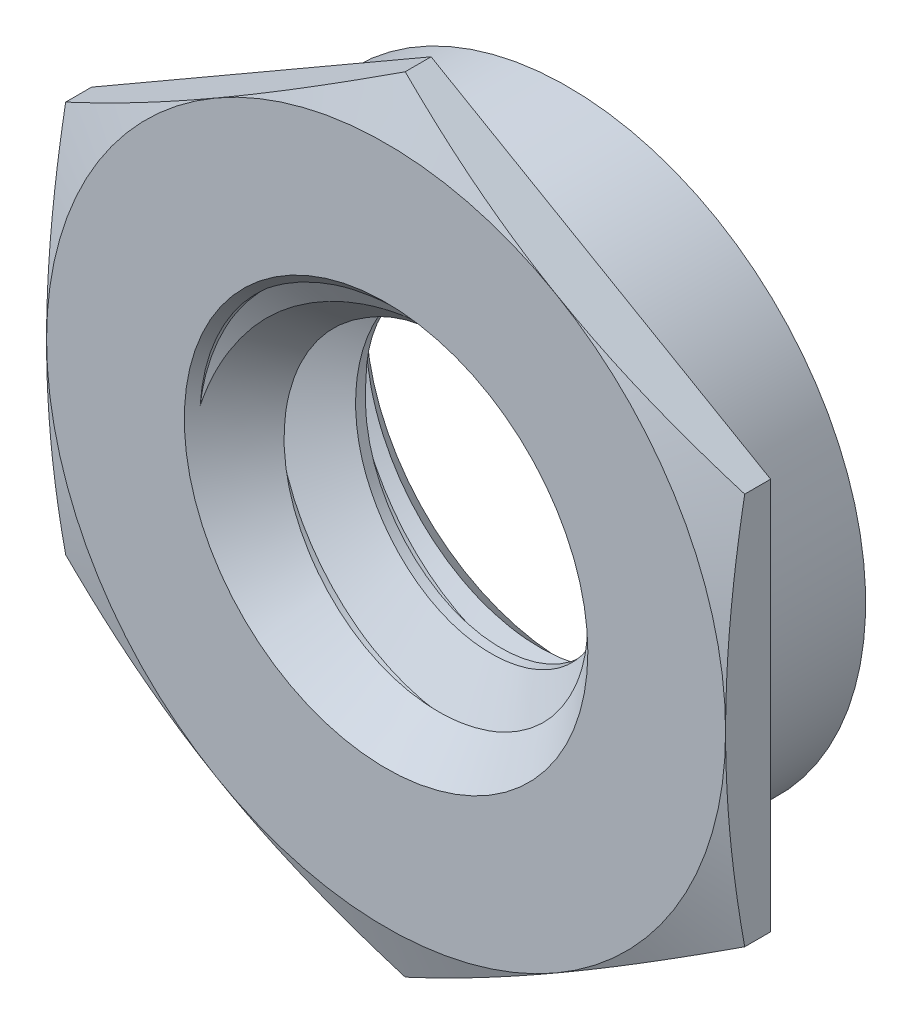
ISO-10303-21;
HEADER;
FILE_DESCRIPTION(('STEP AP214'),'2;1');
FILE_NAME('part.step','',(''),(''),'','','');
FILE_SCHEMA(('AUTOMOTIVE_DESIGN { 1 0 10303 214 1 1 1 1 }'));
ENDSEC;
DATA;
#1=APPLICATION_CONTEXT('core data for automotive mechanical design processes');
#2=APPLICATION_PROTOCOL_DEFINITION('international standard','automotive_design',2000,#1);
#3=PRODUCT_CONTEXT('',#1,'mechanical');
#4=PRODUCT('Part','Part','',(#3));
#5=PRODUCT_RELATED_PRODUCT_CATEGORY('part','',(#4));
#6=PRODUCT_DEFINITION_FORMATION('','',#4);
#7=PRODUCT_DEFINITION_CONTEXT('part definition',#1,'design');
#8=PRODUCT_DEFINITION('design','',#6,#7);
#9=PRODUCT_DEFINITION_SHAPE('','',#8);
#10=(LENGTH_UNIT() NAMED_UNIT(*) SI_UNIT(.MILLI.,.METRE.));
#11=(NAMED_UNIT(*) PLANE_ANGLE_UNIT() SI_UNIT($,.RADIAN.));
#12=(NAMED_UNIT(*) SI_UNIT($,.STERADIAN.) SOLID_ANGLE_UNIT());
#13=UNCERTAINTY_MEASURE_WITH_UNIT(LENGTH_MEASURE(1.E-05),#10,'distance_accuracy_value','');
#14=(GEOMETRIC_REPRESENTATION_CONTEXT(3) GLOBAL_UNCERTAINTY_ASSIGNED_CONTEXT((#13)) GLOBAL_UNIT_ASSIGNED_CONTEXT((#10,
#11,#12)) REPRESENTATION_CONTEXT('',''));
#15=CARTESIAN_POINT('',(0.,0.,0.));
#16=DIRECTION('',(0.,0.,1.));
#17=DIRECTION('',(1.,0.,0.));
#18=AXIS2_PLACEMENT_3D('',#15,#16,#17);
#19=CARTESIAN_POINT('',(5.55625,3.20790243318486,-2.9718));
#20=DIRECTION('',(0.5,0.866025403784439,0.));
#21=DIRECTION('',(-0.866025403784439,0.5,0.));
#22=AXIS2_PLACEMENT_3D('',#19,#20,#21);
#23=PLANE('',#22);
#24=DIRECTION('',(0.,0.,1.));
#25=VECTOR('',#24,1.);
#26=CARTESIAN_POINT('',(0.,6.41580486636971,-2.9718));
#27=LINE('',#26,#25);
#28=CARTESIAN_POINT('',(0.,6.41580486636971,-0.7366));
#29=VERTEX_POINT('',#28);
#30=CARTESIAN_POINT('',(0.,6.41580486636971,-0.312852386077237));
#31=VERTEX_POINT('',#30);
#32=EDGE_CURVE('E155',#29,#31,#27,.T.);
#33=ORIENTED_EDGE('',*,*,#32,.T.);
#34=CARTESIAN_POINT('',(-0.000200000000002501,6.41592033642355,-0.312894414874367));
#35=CARTESIAN_POINT('',(0.229912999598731,6.28306453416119,-0.264520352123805));
#36=CARTESIAN_POINT('',(0.460784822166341,6.14977062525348,-0.220515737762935));
#37=CARTESIAN_POINT('',(0.92402964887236,5.88231609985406,-0.143096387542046));
#38=CARTESIAN_POINT('',(1.15640368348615,5.74815488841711,-0.109689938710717));
#39=CARTESIAN_POINT('',(1.62007406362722,5.48045466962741,-0.0556559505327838));
#40=CARTESIAN_POINT('',(1.85135981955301,5.34692177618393,-0.0349105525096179));
#41=CARTESIAN_POINT('',(2.31447220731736,5.07954371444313,-0.00708513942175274));
#42=CARTESIAN_POINT('',(2.54629860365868,4.94569868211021,0.));
#43=CARTESIAN_POINT('',(3.00995139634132,4.67800861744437,0.));
#44=CARTESIAN_POINT('',(3.24177779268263,4.54416358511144,-0.00708513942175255));
#45=CARTESIAN_POINT('',(3.70489018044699,4.27678552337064,-0.0349105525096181));
#46=CARTESIAN_POINT('',(3.93617593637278,4.14325262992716,-0.0556559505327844));
#47=CARTESIAN_POINT('',(4.39984631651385,3.87555241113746,-0.109689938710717));
#48=CARTESIAN_POINT('',(4.63222035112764,3.74139119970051,-0.143096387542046));
#49=CARTESIAN_POINT('',(5.09546517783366,3.47393667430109,-0.220515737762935));
#50=CARTESIAN_POINT('',(5.32633700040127,3.34064276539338,-0.264520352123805));
#51=CARTESIAN_POINT('',(5.55645,3.20778696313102,-0.312894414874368));
#52=B_SPLINE_CURVE_WITH_KNOTS('',3,(#34,#35,#36,#37,#38,#39,#40,#41,#42,#43,#44,#45,#46,#47,#48,
#49,#50,#51),.UNSPECIFIED.,.F.,.F.,(4,2,2,2,2,2,2,2,4),(0.,0.810320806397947,1.62127367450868,
2.42455761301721,3.22754015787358,4.03052270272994,4.83380664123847,5.64475950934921,
6.45508031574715),.UNSPECIFIED.);
#53=CARTESIAN_POINT('',(2.778125,4.81185364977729,0.));
#54=VERTEX_POINT('',#53);
#55=EDGE_CURVE('E62',#31,#54,#52,.T.);
#56=ORIENTED_EDGE('',*,*,#55,.T.);
#57=CARTESIAN_POINT('',(5.55625,3.20790243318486,-0.312852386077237));
#58=VERTEX_POINT('',#57);
#59=EDGE_CURVE('E133',#54,#58,#52,.T.);
#60=ORIENTED_EDGE('',*,*,#59,.T.);
#61=DIRECTION('',(0.,0.,1.));
#62=VECTOR('',#61,1.);
#63=CARTESIAN_POINT('',(5.55625,3.20790243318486,-2.9718));
#64=LINE('',#63,#62);
#65=CARTESIAN_POINT('',(5.55625,3.20790243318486,-0.7366));
#66=VERTEX_POINT('',#65);
#67=EDGE_CURVE('E249',#66,#58,#64,.T.);
#68=ORIENTED_EDGE('',*,*,#67,.F.);
#69=DIRECTION('',(0.866025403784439,-0.5,0.));
#70=VECTOR('',#69,1.);
#71=CARTESIAN_POINT('',(5.55625,3.20790243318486,-0.7366));
#72=LINE('',#71,#70);
#73=EDGE_CURVE('E262',#29,#66,#72,.T.);
#74=ORIENTED_EDGE('',*,*,#73,.F.);
#75=EDGE_LOOP('',(#33,#56,#60,#68,#74));
#76=FACE_BOUND('',#75,.T.);
#77=ADVANCED_FACE('F38',(#76),#23,.T.);
#78=CARTESIAN_POINT('',(5.55625,-3.20790243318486,-2.9718));
#79=DIRECTION('',(1.,0.,0.));
#80=DIRECTION('',(0.,1.,0.));
#81=AXIS2_PLACEMENT_3D('',#78,#79,#80);
#82=PLANE('',#81);
#83=ORIENTED_EDGE('',*,*,#67,.T.);
#84=CARTESIAN_POINT('',(5.55625000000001,-8.53382402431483,-1.68408108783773));
#85=CARTESIAN_POINT('',(5.55625000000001,-8.28199173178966,-1.60728922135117));
#86=CARTESIAN_POINT('',(5.55625000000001,-8.02988391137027,-1.53138458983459));
#87=CARTESIAN_POINT('',(5.55625000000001,-7.52497683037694,-1.38184055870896));
#88=CARTESIAN_POINT('',(5.55625000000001,-7.27217751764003,-1.30820133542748));
#89=CARTESIAN_POINT('',(5.55625000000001,-6.76532450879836,-1.16355922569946));
#90=CARTESIAN_POINT('',(5.55625,-6.51126936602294,-1.09256139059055));
#91=CARTESIAN_POINT('',(5.55625,-6.00221957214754,-0.954022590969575));
#92=CARTESIAN_POINT('',(5.55625,-5.74722493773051,-0.886481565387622));
#93=CARTESIAN_POINT('',(5.55625,-5.23926323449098,-0.75651584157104));
#94=CARTESIAN_POINT('',(5.55625,-4.98630969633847,-0.694038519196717));
#95=CARTESIAN_POINT('',(5.55625,-4.47914856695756,-0.574342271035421));
#96=CARTESIAN_POINT('',(5.55625,-4.22494095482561,-0.517123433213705));
#97=CARTESIAN_POINT('',(5.55625,-3.71520643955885,-0.409264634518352));
#98=CARTESIAN_POINT('',(5.55625,-3.45967998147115,-0.35862258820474));
#99=CARTESIAN_POINT('',(5.55625,-2.94714167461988,-0.265448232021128));
#100=CARTESIAN_POINT('',(5.55625,-2.69012987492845,-0.222915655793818));
#101=CARTESIAN_POINT('',(5.55625,-2.20347209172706,-0.151883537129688));
#102=CARTESIAN_POINT('',(5.55625,-1.97397892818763,-0.122346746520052));
#103=CARTESIAN_POINT('',(5.55625,-1.51400999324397,-0.0722127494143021));
#104=CARTESIAN_POINT('',(5.55625,-1.28353425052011,-0.0516152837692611));
#105=CARTESIAN_POINT('',(5.55625,-0.82206845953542,-0.0203512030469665));
#106=CARTESIAN_POINT('',(5.55625,-0.591078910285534,-0.00967734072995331));
#107=CARTESIAN_POINT('',(5.55625,-0.128850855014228,0.00119824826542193));
#108=CARTESIAN_POINT('',(5.55625,0.102387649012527,0.00140005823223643));
#109=CARTESIAN_POINT('',(5.55625,0.565811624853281,-0.00870543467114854));
#110=CARTESIAN_POINT('',(5.55625,0.797995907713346,-0.0190663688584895));
#111=CARTESIAN_POINT('',(5.55625,1.26169326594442,-0.0498218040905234));
#112=CARTESIAN_POINT('',(5.55625,1.4932063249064,-0.0702165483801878));
#113=CARTESIAN_POINT('',(5.55625,1.95544404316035,-0.120077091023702));
#114=CARTESIAN_POINT('',(5.55625,2.18616783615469,-0.14955080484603));
#115=CARTESIAN_POINT('',(5.55625,2.64646085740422,-0.216361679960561));
#116=CARTESIAN_POINT('',(5.55625,2.87603008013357,-0.25369887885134));
#117=CARTESIAN_POINT('',(5.55625,3.34912097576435,-0.337696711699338));
#118=CARTESIAN_POINT('',(5.55625,3.59256146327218,-0.384810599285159));
#119=CARTESIAN_POINT('',(5.55625,4.07817315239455,-0.485217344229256));
#120=CARTESIAN_POINT('',(5.55625,4.32034425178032,-0.538510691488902));
#121=CARTESIAN_POINT('',(5.55625,4.80359618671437,-0.650123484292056));
#122=CARTESIAN_POINT('',(5.55625,5.04467666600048,-0.708444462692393));
#123=CARTESIAN_POINT('',(5.55625,5.52580943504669,-0.829139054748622));
#124=CARTESIAN_POINT('',(5.55625,5.76586175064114,-0.891512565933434));
#125=CARTESIAN_POINT('',(5.55625,6.24540707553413,-1.01962954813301));
#126=CARTESIAN_POINT('',(5.55625,6.48489890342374,-1.08537742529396));
#127=CARTESIAN_POINT('',(5.55625,6.96313032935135,-1.21955923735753));
#128=CARTESIAN_POINT('',(5.55625,7.2018699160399,-1.28799321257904));
#129=CARTESIAN_POINT('',(5.55625,7.91704239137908,-1.49654388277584));
#130=CARTESIAN_POINT('',(5.55625,8.3925200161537,-1.63993406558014));
#131=CARTESIAN_POINT('',(5.55625,9.33637401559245,-1.93105158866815));
#132=CARTESIAN_POINT('',(5.55625,9.80477076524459,-2.07871341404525));
#133=CARTESIAN_POINT('',(5.55625,10.740254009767,-2.37820255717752));
#134=CARTESIAN_POINT('',(5.55625,11.2073404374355,-2.53003008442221));
#135=CARTESIAN_POINT('',(5.55625,12.1386871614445,-2.83610823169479));
#136=CARTESIAN_POINT('',(5.55625,12.6029513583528,-2.99034701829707));
#137=CARTESIAN_POINT('',(5.55625,13.5306717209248,-3.30110857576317));
#138=CARTESIAN_POINT('',(5.55625,13.9941279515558,-3.45763115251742));
#139=CARTESIAN_POINT('',(5.55625,14.4573099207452,-3.61495044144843));
#140=B_SPLINE_CURVE_WITH_KNOTS('',3,(#84,#85,#86,#87,#88,#89,#90,#91,#92,#93,#94,#95,#96,#97,
#98,#99,#100,#101,#102,#103,#104,#105,#106,#107,#108,#109,#110,#111,#112,#113,#114,#115,#116,
#117,#118,#119,#120,#121,#122,#123,#124,#125,#126,#127,#128,#129,#130,#131,#132,#133,#134,#135,
#136,#137,#138,#139),.UNSPECIFIED.,.F.,.F.,(4,2,2,2,2,2,2,2,2,2,2,2,2,2,2,2,2,2,2,2,2,2,2,2,2,2,
2,4),(0.,0.789846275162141,1.57975387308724,2.37110162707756,3.16243539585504,3.94405599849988,
4.72568967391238,5.50707489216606,6.28843444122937,6.98244146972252,7.6764283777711,
8.36990806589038,9.06338223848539,9.76039508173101,10.4574248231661,11.1550639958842,
11.8527065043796,12.5964804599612,13.340313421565,14.0843739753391,14.8284157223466,
15.5734550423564,16.3185055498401,17.8083236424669,19.281663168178,20.7550769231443,
22.2227141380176,23.6902273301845),.UNSPECIFIED.);
#141=CARTESIAN_POINT('',(5.55625,0.,0.));
#142=VERTEX_POINT('',#141);
#143=EDGE_CURVE('E136',#58,#142,#140,.F.);
#144=ORIENTED_EDGE('',*,*,#143,.T.);
#145=CARTESIAN_POINT('',(5.55625,-3.20790243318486,-0.312852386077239));
#146=VERTEX_POINT('',#145);
#147=EDGE_CURVE('E166',#142,#146,#140,.F.);
#148=ORIENTED_EDGE('',*,*,#147,.T.);
#149=DIRECTION('',(0.,0.,1.));
#150=VECTOR('',#149,1.);
#151=CARTESIAN_POINT('',(5.55625,-3.20790243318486,-2.9718));
#152=LINE('',#151,#150);
#153=CARTESIAN_POINT('',(5.55625,-3.20790243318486,-0.7366));
#154=VERTEX_POINT('',#153);
#155=EDGE_CURVE('E254',#154,#146,#152,.T.);
#156=ORIENTED_EDGE('',*,*,#155,.F.);
#157=DIRECTION('',(0.,-1.,0.));
#158=VECTOR('',#157,1.);
#159=CARTESIAN_POINT('',(5.55625,-3.20790243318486,-0.7366));
#160=LINE('',#159,#158);
#161=EDGE_CURVE('E252',#66,#154,#160,.T.);
#162=ORIENTED_EDGE('',*,*,#161,.F.);
#163=EDGE_LOOP('',(#83,#144,#148,#156,#162));
#164=FACE_BOUND('',#163,.T.);
#165=ADVANCED_FACE('F220',(#164),#82,.T.);
#166=CARTESIAN_POINT('',(0.,-6.41580486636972,-2.9718));
#167=DIRECTION('',(0.5,-0.866025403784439,0.));
#168=DIRECTION('',(0.866025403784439,0.5,0.));
#169=AXIS2_PLACEMENT_3D('',#166,#167,#168);
#170=PLANE('',#169);
#171=ORIENTED_EDGE('',*,*,#155,.T.);
#172=CARTESIAN_POINT('',(5.55645,-3.20778696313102,-0.312894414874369));
#173=CARTESIAN_POINT('',(5.32633700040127,-3.34064276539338,-0.264520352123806));
#174=CARTESIAN_POINT('',(5.09546517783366,-3.47393667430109,-0.220515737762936));
#175=CARTESIAN_POINT('',(4.63222035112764,-3.74139119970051,-0.143096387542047));
#176=CARTESIAN_POINT('',(4.39984631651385,-3.87555241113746,-0.109689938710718));
#177=CARTESIAN_POINT('',(3.93617593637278,-4.14325262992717,-0.0556559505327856));
#178=CARTESIAN_POINT('',(3.704890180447,-4.27678552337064,-0.0349105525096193));
#179=CARTESIAN_POINT('',(3.24177779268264,-4.54416358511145,-0.00708513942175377));
#180=CARTESIAN_POINT('',(3.00995139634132,-4.67800861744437,0.));
#181=CARTESIAN_POINT('',(2.54629860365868,-4.94569868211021,0.));
#182=CARTESIAN_POINT('',(2.31447220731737,-5.07954371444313,-0.00708513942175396));
#183=CARTESIAN_POINT('',(1.85135981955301,-5.34692177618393,-0.0349105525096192));
#184=CARTESIAN_POINT('',(1.62007406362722,-5.48045466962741,-0.0556559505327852));
#185=CARTESIAN_POINT('',(1.15640368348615,-5.74815488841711,-0.109689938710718));
#186=CARTESIAN_POINT('',(0.924029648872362,-5.88231609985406,-0.143096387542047));
#187=CARTESIAN_POINT('',(0.460784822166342,-6.14977062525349,-0.220515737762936));
#188=CARTESIAN_POINT('',(0.229912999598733,-6.2830645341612,-0.264520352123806));
#189=CARTESIAN_POINT('',(-0.00020000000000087,-6.41592033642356,-0.312894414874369));
#190=B_SPLINE_CURVE_WITH_KNOTS('',3,(#172,#173,#174,#175,#176,#177,#178,#179,#180,#181,#182,
#183,#184,#185,#186,#187,#188,#189),.UNSPECIFIED.,.F.,.F.,(4,2,2,2,2,2,2,2,4),(0.,
0.810320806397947,1.62127367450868,2.42455761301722,3.22754015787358,4.03052270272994,
4.83380664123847,5.64475950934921,6.45508031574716),.UNSPECIFIED.);
#191=CARTESIAN_POINT('',(2.778125,-4.81185364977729,0.));
#192=VERTEX_POINT('',#191);
#193=EDGE_CURVE('E214',#146,#192,#190,.T.);
#194=ORIENTED_EDGE('',*,*,#193,.T.);
#195=CARTESIAN_POINT('',(0.,-6.41580486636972,-0.312852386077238));
#196=VERTEX_POINT('',#195);
#197=EDGE_CURVE('E207',#192,#196,#190,.T.);
#198=ORIENTED_EDGE('',*,*,#197,.T.);
#199=DIRECTION('',(0.,0.,1.));
#200=VECTOR('',#199,1.);
#201=CARTESIAN_POINT('',(0.,-6.41580486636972,-2.9718));
#202=LINE('',#201,#200);
#203=CARTESIAN_POINT('',(0.,-6.41580486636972,-0.7366));
#204=VERTEX_POINT('',#203);
#205=EDGE_CURVE('E259',#204,#196,#202,.T.);
#206=ORIENTED_EDGE('',*,*,#205,.F.);
#207=DIRECTION('',(-0.866025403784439,-0.5,0.));
#208=VECTOR('',#207,1.);
#209=CARTESIAN_POINT('',(0.,-6.41580486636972,-0.7366));
#210=LINE('',#209,#208);
#211=EDGE_CURVE('E340',#154,#204,#210,.T.);
#212=ORIENTED_EDGE('',*,*,#211,.F.);
#213=EDGE_LOOP('',(#171,#194,#198,#206,#212));
#214=FACE_BOUND('',#213,.T.);
#215=ADVANCED_FACE('F216',(#214),#170,.T.);
#216=CARTESIAN_POINT('',(-5.55625,-3.20790243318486,-2.9718));
#217=DIRECTION('',(-0.5,-0.866025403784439,0.));
#218=DIRECTION('',(0.866025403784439,-0.5,0.));
#219=AXIS2_PLACEMENT_3D('',#216,#217,#218);
#220=PLANE('',#219);
#221=ORIENTED_EDGE('',*,*,#205,.T.);
#222=CARTESIAN_POINT('',(0.000199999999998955,-6.41592033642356,-0.312894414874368));
#223=CARTESIAN_POINT('',(-0.229912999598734,-6.28306453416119,-0.264520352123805));
#224=CARTESIAN_POINT('',(-0.460784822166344,-6.14977062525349,-0.220515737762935));
#225=CARTESIAN_POINT('',(-0.924029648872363,-5.88231609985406,-0.143096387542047));
#226=CARTESIAN_POINT('',(-1.15640368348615,-5.74815488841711,-0.109689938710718));
#227=CARTESIAN_POINT('',(-1.62007406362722,-5.48045466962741,-0.0556559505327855));
#228=CARTESIAN_POINT('',(-1.85135981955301,-5.34692177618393,-0.0349105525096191));
#229=CARTESIAN_POINT('',(-2.31447220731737,-5.07954371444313,-0.00708513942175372));
#230=CARTESIAN_POINT('',(-2.54629860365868,-4.94569868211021,0.));
#231=CARTESIAN_POINT('',(-3.00995139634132,-4.67800861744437,0.));
#232=CARTESIAN_POINT('',(-3.24177779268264,-4.54416358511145,-0.00708513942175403));
#233=CARTESIAN_POINT('',(-3.70489018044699,-4.27678552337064,-0.0349105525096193));
#234=CARTESIAN_POINT('',(-3.93617593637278,-4.14325262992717,-0.0556559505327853));
#235=CARTESIAN_POINT('',(-4.39984631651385,-3.87555241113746,-0.109689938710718));
#236=CARTESIAN_POINT('',(-4.63222035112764,-3.74139119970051,-0.143096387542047));
#237=CARTESIAN_POINT('',(-5.09546517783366,-3.47393667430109,-0.220515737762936));
#238=CARTESIAN_POINT('',(-5.32633700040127,-3.34064276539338,-0.264520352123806));
#239=CARTESIAN_POINT('',(-5.55645,-3.20778696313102,-0.312894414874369));
#240=B_SPLINE_CURVE_WITH_KNOTS('',3,(#222,#223,#224,#225,#226,#227,#228,#229,#230,#231,#232,
#233,#234,#235,#236,#237,#238,#239),.UNSPECIFIED.,.F.,.F.,(4,2,2,2,2,2,2,2,4),(0.,
0.810320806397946,1.62127367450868,2.42455761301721,3.22754015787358,4.03052270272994,
4.83380664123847,5.6447595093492,6.45508031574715),.UNSPECIFIED.);
#241=CARTESIAN_POINT('',(-2.778125,-4.81185364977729,0.));
#242=VERTEX_POINT('',#241);
#243=EDGE_CURVE('E215',#196,#242,#240,.T.);
#244=ORIENTED_EDGE('',*,*,#243,.T.);
#245=CARTESIAN_POINT('',(-5.55625,-3.20790243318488,-0.312852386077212));
#246=VERTEX_POINT('',#245);
#247=EDGE_CURVE('E201',#242,#246,#240,.T.);
#248=ORIENTED_EDGE('',*,*,#247,.T.);
#249=DIRECTION('',(0.,0.,1.));
#250=VECTOR('',#249,1.);
#251=CARTESIAN_POINT('',(-5.55625,-3.20790243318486,-2.9718));
#252=LINE('',#251,#250);
#253=CARTESIAN_POINT('',(-5.55625,-3.20790243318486,-0.7366));
#254=VERTEX_POINT('',#253);
#255=EDGE_CURVE('E267',#254,#246,#252,.T.);
#256=ORIENTED_EDGE('',*,*,#255,.F.);
#257=DIRECTION('',(-0.866025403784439,0.5,0.));
#258=VECTOR('',#257,1.);
#259=CARTESIAN_POINT('',(-5.55625,-3.20790243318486,-0.7366));
#260=LINE('',#259,#258);
#261=EDGE_CURVE('E338',#204,#254,#260,.T.);
#262=ORIENTED_EDGE('',*,*,#261,.F.);
#263=EDGE_LOOP('',(#221,#244,#248,#256,#262));
#264=FACE_BOUND('',#263,.T.);
#265=ADVANCED_FACE('F219',(#264),#220,.T.);
#266=CARTESIAN_POINT('',(-5.55625,3.20790243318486,-2.9718));
#267=DIRECTION('',(-1.,0.,0.));
#268=DIRECTION('',(0.,0.,1.));
#269=AXIS2_PLACEMENT_3D('',#266,#267,#268);
#270=PLANE('',#269);
#271=ORIENTED_EDGE('',*,*,#255,.T.);
#272=CARTESIAN_POINT('',(-5.55625,-8.53382402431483,-1.68408108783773));
#273=CARTESIAN_POINT('',(-5.55625,-8.28199173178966,-1.60728922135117));
#274=CARTESIAN_POINT('',(-5.55625,-8.02988391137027,-1.53138458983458));
#275=CARTESIAN_POINT('',(-5.55625,-7.52497683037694,-1.38184055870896));
#276=CARTESIAN_POINT('',(-5.55625,-7.27217751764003,-1.30820133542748));
#277=CARTESIAN_POINT('',(-5.55625,-6.76532450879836,-1.16355922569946));
#278=CARTESIAN_POINT('',(-5.55625,-6.51126936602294,-1.09256139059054));
#279=CARTESIAN_POINT('',(-5.55625,-6.00221957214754,-0.954022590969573));
#280=CARTESIAN_POINT('',(-5.55625,-5.74722493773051,-0.886481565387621));
#281=CARTESIAN_POINT('',(-5.55625,-5.23926323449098,-0.756515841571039));
#282=CARTESIAN_POINT('',(-5.55625,-4.98630969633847,-0.694038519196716));
#283=CARTESIAN_POINT('',(-5.55625,-4.47914856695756,-0.57434227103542));
#284=CARTESIAN_POINT('',(-5.55625,-4.22494095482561,-0.517123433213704));
#285=CARTESIAN_POINT('',(-5.55625,-3.71520643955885,-0.409264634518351));
#286=CARTESIAN_POINT('',(-5.55625,-3.45967998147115,-0.358622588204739));
#287=CARTESIAN_POINT('',(-5.55625,-2.94714167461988,-0.265448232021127));
#288=CARTESIAN_POINT('',(-5.55625,-2.69012987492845,-0.222915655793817));
#289=CARTESIAN_POINT('',(-5.55625,-2.20347209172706,-0.151883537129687));
#290=CARTESIAN_POINT('',(-5.55625,-1.97397892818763,-0.122346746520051));
#291=CARTESIAN_POINT('',(-5.55625,-1.51400999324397,-0.0722127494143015));
#292=CARTESIAN_POINT('',(-5.55625,-1.28353425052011,-0.0516152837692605));
#293=CARTESIAN_POINT('',(-5.55625,-0.822068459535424,-0.0203512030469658));
#294=CARTESIAN_POINT('',(-5.55625,-0.591078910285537,-0.0096773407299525));
#295=CARTESIAN_POINT('',(-5.55625,-0.128850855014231,0.00119824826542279));
#296=CARTESIAN_POINT('',(-5.55625,0.102387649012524,0.00140005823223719));
#297=CARTESIAN_POINT('',(-5.55625,0.565811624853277,-0.00870543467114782));
#298=CARTESIAN_POINT('',(-5.55625,0.797995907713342,-0.0190663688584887));
#299=CARTESIAN_POINT('',(-5.55625,1.26169326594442,-0.0498218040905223));
#300=CARTESIAN_POINT('',(-5.55625,1.49320632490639,-0.0702165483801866));
#301=CARTESIAN_POINT('',(-5.55625,1.95544404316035,-0.120077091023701));
#302=CARTESIAN_POINT('',(-5.55625,2.18616783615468,-0.149550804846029));
#303=CARTESIAN_POINT('',(-5.55625,2.64646085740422,-0.21636167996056));
#304=CARTESIAN_POINT('',(-5.55625,2.87603008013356,-0.253698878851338));
#305=CARTESIAN_POINT('',(-5.55625,3.34912097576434,-0.337696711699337));
#306=CARTESIAN_POINT('',(-5.55625,3.59256146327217,-0.384810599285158));
#307=CARTESIAN_POINT('',(-5.55625,4.07817315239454,-0.485217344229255));
#308=CARTESIAN_POINT('',(-5.55625,4.32034425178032,-0.538510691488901));
#309=CARTESIAN_POINT('',(-5.55625,4.80359618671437,-0.650123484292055));
#310=CARTESIAN_POINT('',(-5.55625,5.04467666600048,-0.708444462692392));
#311=CARTESIAN_POINT('',(-5.55625,5.52580943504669,-0.829139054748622));
#312=CARTESIAN_POINT('',(-5.55625,5.76586175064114,-0.891512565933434));
#313=CARTESIAN_POINT('',(-5.55625,6.24540707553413,-1.01962954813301));
#314=CARTESIAN_POINT('',(-5.55625,6.48489890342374,-1.08537742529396));
#315=CARTESIAN_POINT('',(-5.55625,6.96313032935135,-1.21955923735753));
#316=CARTESIAN_POINT('',(-5.55625,7.2018699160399,-1.28799321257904));
#317=CARTESIAN_POINT('',(-5.55625,7.91704239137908,-1.49654388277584));
#318=CARTESIAN_POINT('',(-5.55625,8.3925200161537,-1.63993406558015));
#319=CARTESIAN_POINT('',(-5.55625,9.33637401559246,-1.93105158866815));
#320=CARTESIAN_POINT('',(-5.55625,9.80477076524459,-2.07871341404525));
#321=CARTESIAN_POINT('',(-5.55625,10.740254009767,-2.37820255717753));
#322=CARTESIAN_POINT('',(-5.55625,11.2073404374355,-2.53003008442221));
#323=CARTESIAN_POINT('',(-5.55625,12.1386871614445,-2.83610823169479));
#324=CARTESIAN_POINT('',(-5.55625,12.6029513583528,-2.99034701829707));
#325=CARTESIAN_POINT('',(-5.55625,13.5306717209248,-3.30110857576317));
#326=CARTESIAN_POINT('',(-5.55625,13.9941279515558,-3.45763115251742));
#327=CARTESIAN_POINT('',(-5.55625,14.4573099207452,-3.61495044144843));
#328=B_SPLINE_CURVE_WITH_KNOTS('',3,(#272,#273,#274,#275,#276,#277,#278,#279,#280,#281,#282,
#283,#284,#285,#286,#287,#288,#289,#290,#291,#292,#293,#294,#295,#296,#297,#298,#299,#300,#301,
#302,#303,#304,#305,#306,#307,#308,#309,#310,#311,#312,#313,#314,#315,#316,#317,#318,#319,#320,
#321,#322,#323,#324,#325,#326,#327),.UNSPECIFIED.,.F.,.F.,(4,2,2,2,2,2,2,2,2,2,2,2,2,2,2,2,2,2,
2,2,2,2,2,2,2,2,2,4),(0.,0.789846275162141,1.57975387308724,2.37110162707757,3.16243539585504,
3.94405599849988,4.72568967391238,5.50707489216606,6.28843444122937,6.98244146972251,
7.6764283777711,8.36990806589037,9.06338223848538,9.76039508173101,10.4574248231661,
11.1550639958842,11.8527065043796,12.5964804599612,13.3403134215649,14.0843739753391,
14.8284157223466,15.5734550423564,16.3185055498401,17.8083236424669,19.281663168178,
20.7550769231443,22.2227141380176,23.6902273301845),.UNSPECIFIED.);
#329=CARTESIAN_POINT('',(-5.55625,0.,0.));
#330=VERTEX_POINT('',#329);
#331=EDGE_CURVE('E347',#246,#330,#328,.T.);
#332=ORIENTED_EDGE('',*,*,#331,.T.);
#333=CARTESIAN_POINT('',(-5.55625,3.20790243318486,-0.312852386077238));
#334=VERTEX_POINT('',#333);
#335=EDGE_CURVE('E194',#330,#334,#328,.T.);
#336=ORIENTED_EDGE('',*,*,#335,.T.);
#337=DIRECTION('',(0.,0.,1.));
#338=VECTOR('',#337,1.);
#339=CARTESIAN_POINT('',(-5.55625,3.20790243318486,-2.9718));
#340=LINE('',#339,#338);
#341=CARTESIAN_POINT('',(-5.55625,3.20790243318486,-0.7366));
#342=VERTEX_POINT('',#341);
#343=EDGE_CURVE('E270',#342,#334,#340,.T.);
#344=ORIENTED_EDGE('',*,*,#343,.F.);
#345=DIRECTION('',(0.,1.,0.));
#346=VECTOR('',#345,1.);
#347=CARTESIAN_POINT('',(-5.55625,3.20790243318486,-0.7366));
#348=LINE('',#347,#346);
#349=EDGE_CURVE('E328',#254,#342,#348,.T.);
#350=ORIENTED_EDGE('',*,*,#349,.F.);
#351=EDGE_LOOP('',(#271,#332,#336,#344,#350));
#352=FACE_BOUND('',#351,.T.);
#353=ADVANCED_FACE('F226',(#352),#270,.T.);
#354=CARTESIAN_POINT('',(0.,6.41580486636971,-2.9718));
#355=DIRECTION('',(-0.5,0.866025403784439,0.));
#356=DIRECTION('',(-0.866025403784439,-0.5,0.));
#357=AXIS2_PLACEMENT_3D('',#354,#355,#356);
#358=PLANE('',#357);
#359=ORIENTED_EDGE('',*,*,#343,.T.);
#360=CARTESIAN_POINT('',(-5.55645,3.20778696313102,-0.312894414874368));
#361=CARTESIAN_POINT('',(-5.32633700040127,3.34064276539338,-0.264520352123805));
#362=CARTESIAN_POINT('',(-5.09546517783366,3.47393667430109,-0.220515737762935));
#363=CARTESIAN_POINT('',(-4.63222035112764,3.74139119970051,-0.143096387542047));
#364=CARTESIAN_POINT('',(-4.39984631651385,3.87555241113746,-0.109689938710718));
#365=CARTESIAN_POINT('',(-3.93617593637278,4.14325262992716,-0.055655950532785));
#366=CARTESIAN_POINT('',(-3.70489018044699,4.27678552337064,-0.0349105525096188));
#367=CARTESIAN_POINT('',(-3.24177779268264,4.54416358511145,-0.00708513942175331));
#368=CARTESIAN_POINT('',(-3.00995139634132,4.67800861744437,0.));
#369=CARTESIAN_POINT('',(-2.54629860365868,4.94569868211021,0.));
#370=CARTESIAN_POINT('',(-2.31447220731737,5.07954371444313,-0.00708513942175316));
#371=CARTESIAN_POINT('',(-1.85135981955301,5.34692177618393,-0.0349105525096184));
#372=CARTESIAN_POINT('',(-1.62007406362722,5.48045466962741,-0.0556559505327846));
#373=CARTESIAN_POINT('',(-1.15640368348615,5.74815488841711,-0.109689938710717));
#374=CARTESIAN_POINT('',(-0.924029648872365,5.88231609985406,-0.143096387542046));
#375=CARTESIAN_POINT('',(-0.460784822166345,6.14977062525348,-0.220515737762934));
#376=CARTESIAN_POINT('',(-0.229912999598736,6.28306453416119,-0.264520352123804));
#377=CARTESIAN_POINT('',(0.000199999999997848,6.41592033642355,-0.312894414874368));
#378=B_SPLINE_CURVE_WITH_KNOTS('',3,(#360,#361,#362,#363,#364,#365,#366,#367,#368,#369,#370,
#371,#372,#373,#374,#375,#376,#377),.UNSPECIFIED.,.F.,.F.,(4,2,2,2,2,2,2,2,4),(0.,
0.810320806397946,1.62127367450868,2.42455761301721,3.22754015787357,4.03052270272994,
4.83380664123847,5.6447595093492,6.45508031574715),.UNSPECIFIED.);
#379=CARTESIAN_POINT('',(-2.778125,4.81185364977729,0.));
#380=VERTEX_POINT('',#379);
#381=EDGE_CURVE('E345',#334,#380,#378,.T.);
#382=ORIENTED_EDGE('',*,*,#381,.T.);
#383=EDGE_CURVE('E142',#380,#31,#378,.T.);
#384=ORIENTED_EDGE('',*,*,#383,.T.);
#385=ORIENTED_EDGE('',*,*,#32,.F.);
#386=DIRECTION('',(0.866025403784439,0.5,0.));
#387=VECTOR('',#386,1.);
#388=CARTESIAN_POINT('',(0.,6.41580486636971,-0.7366));
#389=LINE('',#388,#387);
#390=EDGE_CURVE('E253',#342,#29,#389,.T.);
#391=ORIENTED_EDGE('',*,*,#390,.F.);
#392=EDGE_LOOP('',(#359,#382,#384,#385,#391));
#393=FACE_BOUND('',#392,.T.);
#394=ADVANCED_FACE('F230',(#393),#358,.T.);
#395=CARTESIAN_POINT('',(-5.55625,9.62370729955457,0.));
#396=DIRECTION('',(0.,0.,1.));
#397=DIRECTION('',(1.,0.,0.));
#398=AXIS2_PLACEMENT_3D('',#395,#396,#397);
#399=PLANE('',#398);
#400=CARTESIAN_POINT('',(0.,0.,0.));
#401=DIRECTION('',(0.,0.,1.));
#402=DIRECTION('',(1.,0.,0.));
#403=AXIS2_PLACEMENT_3D('',#400,#401,#402);
#404=CIRCLE('',#403,3.302);
#405=CARTESIAN_POINT('',(3.302,0.,0.));
#406=VERTEX_POINT('',#405);
#407=EDGE_CURVE('E532',#406,#406,#404,.T.);
#408=ORIENTED_EDGE('',*,*,#407,.F.);
#409=EDGE_LOOP('',(#408));
#410=FACE_BOUND('',#409,.T.);
#411=CARTESIAN_POINT('',(0.,0.,0.));
#412=DIRECTION('',(0.,0.,1.));
#413=DIRECTION('',(1.,0.,0.));
#414=AXIS2_PLACEMENT_3D('',#411,#412,#413);
#415=CIRCLE('',#414,5.55625);
#416=EDGE_CURVE('E42',#192,#142,#415,.T.);
#417=ORIENTED_EDGE('',*,*,#416,.T.);
#418=CARTESIAN_POINT('',(0.,0.,0.));
#419=DIRECTION('',(0.,0.,1.));
#420=DIRECTION('',(1.,0.,0.));
#421=AXIS2_PLACEMENT_3D('',#418,#419,#420);
#422=CIRCLE('',#421,5.55625);
#423=EDGE_CURVE('E54',#142,#54,#422,.T.);
#424=ORIENTED_EDGE('',*,*,#423,.T.);
#425=EDGE_CURVE('E13',#54,#380,#415,.T.);
#426=ORIENTED_EDGE('',*,*,#425,.T.);
#427=EDGE_CURVE('E47',#380,#330,#415,.T.);
#428=ORIENTED_EDGE('',*,*,#427,.T.);
#429=EDGE_CURVE('E363',#330,#242,#415,.T.);
#430=ORIENTED_EDGE('',*,*,#429,.T.);
#431=EDGE_CURVE('E357',#242,#192,#415,.T.);
#432=ORIENTED_EDGE('',*,*,#431,.T.);
#433=EDGE_LOOP('',(#417,#424,#426,#428,#430,#432));
#434=FACE_BOUND('',#433,.T.);
#435=ADVANCED_FACE('F148',(#410,#434),#399,.T.);
#436=CARTESIAN_POINT('',(0.,3.175,-2.9718));
#437=CARTESIAN_POINT('',(-1.83308710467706,3.175,-2.86596666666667));
#438=CARTESIAN_POINT('',(-2.74963065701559,1.5875,-2.76013333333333));
#439=CARTESIAN_POINT('',(-3.66617420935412,0.,-2.6543));
#440=CARTESIAN_POINT('',(-2.74963065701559,-1.5875,-2.54846666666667));
#441=CARTESIAN_POINT('',(-1.83308710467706,-3.175,-2.44263333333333));
#442=CARTESIAN_POINT('',(0.,-3.175,-2.3368));
#443=CARTESIAN_POINT('',(1.83308710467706,-3.175,-2.23096666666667));
#444=CARTESIAN_POINT('',(2.74963065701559,-1.5875,-2.12513333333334));
#445=CARTESIAN_POINT('',(3.66617420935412,0.,-2.0193));
#446=CARTESIAN_POINT('',(2.74963065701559,1.5875,-1.91346666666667));
#447=CARTESIAN_POINT('',(1.83308710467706,3.175,-1.80763333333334));
#448=CARTESIAN_POINT('',(0.,3.175,-1.7018));
#449=CARTESIAN_POINT('',(-1.83308710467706,3.175,-1.59596666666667));
#450=CARTESIAN_POINT('',(-2.74963065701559,1.5875,-1.49013333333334));
#451=CARTESIAN_POINT('',(-3.66617420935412,0.,-1.3843));
#452=CARTESIAN_POINT('',(-2.74963065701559,-1.5875,-1.27846666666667));
#453=CARTESIAN_POINT('',(-1.83308710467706,-3.175,-1.17263333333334));
#454=CARTESIAN_POINT('',(0.,-3.175,-1.0668));
#455=CARTESIAN_POINT('',(1.83308710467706,-3.175,-0.960966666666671));
#456=CARTESIAN_POINT('',(2.74963065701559,-1.5875,-0.855133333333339));
#457=CARTESIAN_POINT('',(3.66617420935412,0.,-0.749300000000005));
#458=CARTESIAN_POINT('',(2.74963065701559,1.5875,-0.643466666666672));
#459=CARTESIAN_POINT('',(1.83308710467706,3.175,-0.537633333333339));
#460=CARTESIAN_POINT('',(0.,3.175,-0.431800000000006));
#461=CARTESIAN_POINT('',(-1.83308710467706,3.175,-0.325966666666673));
#462=CARTESIAN_POINT('',(-2.74963065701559,1.5875,-0.22013333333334));
#463=CARTESIAN_POINT('',(-3.66617420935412,0.,-0.114300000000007));
#464=CARTESIAN_POINT('',(-2.74963065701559,-1.5875,-0.00846666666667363));
#465=CARTESIAN_POINT('',(-1.83308710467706,-3.175,0.0973666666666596));
#466=CARTESIAN_POINT('',(0.,-3.175,0.203199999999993));
#467=CARTESIAN_POINT('',(1.83308710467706,-3.175,0.309033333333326));
#468=CARTESIAN_POINT('',(2.74963065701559,-1.5875,0.414866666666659));
#469=CARTESIAN_POINT('',(3.66617420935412,0.,0.520699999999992));
#470=CARTESIAN_POINT('',(2.74963065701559,1.5875,0.626533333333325));
#471=CARTESIAN_POINT('',(1.83308710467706,3.175,0.732366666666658));
#472=CARTESIAN_POINT('',(0.,3.175,0.838199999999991));
#473=CARTESIAN_POINT('',(-1.83308710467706,3.175,0.944033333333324));
#474=CARTESIAN_POINT('',(-2.74963065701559,1.5875,1.04986666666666));
#475=CARTESIAN_POINT('',(-3.66617420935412,0.,1.15569999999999));
#476=CARTESIAN_POINT('',(-2.74963065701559,-1.5875,1.26153333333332));
#477=CARTESIAN_POINT('',(-1.83308710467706,-3.175,1.36736666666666));
#478=CARTESIAN_POINT('',(0.,-3.175,1.47319999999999));
#479=CARTESIAN_POINT('',(1.83308710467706,-3.175,1.57903333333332));
#480=CARTESIAN_POINT('',(2.74963065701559,-1.5875,1.68486666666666));
#481=CARTESIAN_POINT('',(3.66617420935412,0.,1.79069999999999));
#482=CARTESIAN_POINT('',(2.74963065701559,1.5875,1.89653333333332));
#483=CARTESIAN_POINT('',(1.83308710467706,3.175,2.00236666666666));
#484=CARTESIAN_POINT('',(0.,3.175,2.10819999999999));
#485=CARTESIAN_POINT('',(-1.83308710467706,3.175,2.21403333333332));
#486=CARTESIAN_POINT('',(-2.74963065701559,1.5875,2.31986666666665));
#487=CARTESIAN_POINT('',(-3.66617420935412,0.,2.42569999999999));
#488=CARTESIAN_POINT('',(-2.74963065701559,-1.5875,2.53153333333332));
#489=CARTESIAN_POINT('',(-1.83308710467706,-3.175,2.63736666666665));
#490=CARTESIAN_POINT('',(0.,-3.175,2.74319999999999));
#491=CARTESIAN_POINT('',(1.83308710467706,-3.175,2.84903333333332));
#492=CARTESIAN_POINT('',(2.74963065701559,-1.5875,2.95486666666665));
#493=CARTESIAN_POINT('',(3.66617420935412,0.,3.06069999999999));
#494=CARTESIAN_POINT('',(2.74963065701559,1.5875,3.16653333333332));
#495=CARTESIAN_POINT('',(1.83308710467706,3.175,3.27236666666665));
#496=CARTESIAN_POINT('',(0.,3.175,3.37819999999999));
#497=CARTESIAN_POINT('',(0.,2.35011080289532,-3.44805));
#498=CARTESIAN_POINT('',(-1.35683710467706,2.35011080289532,-3.34221666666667));
#499=CARTESIAN_POINT('',(-2.03525565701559,1.17505540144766,-3.23638333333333));
#500=CARTESIAN_POINT('',(-2.71367420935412,0.,-3.13055));
#501=CARTESIAN_POINT('',(-2.03525565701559,-1.17505540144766,-3.02471666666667));
#502=CARTESIAN_POINT('',(-1.35683710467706,-2.35011080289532,-2.91888333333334));
#503=CARTESIAN_POINT('',(0.,-2.35011080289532,-2.81305));
#504=CARTESIAN_POINT('',(1.35683710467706,-2.35011080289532,-2.70721666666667));
#505=CARTESIAN_POINT('',(2.03525565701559,-1.17505540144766,-2.60138333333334));
#506=CARTESIAN_POINT('',(2.71367420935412,0.,-2.49555));
#507=CARTESIAN_POINT('',(2.03525565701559,1.17505540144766,-2.38971666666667));
#508=CARTESIAN_POINT('',(1.35683710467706,2.35011080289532,-2.28388333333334));
#509=CARTESIAN_POINT('',(0.,2.35011080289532,-2.17805));
#510=CARTESIAN_POINT('',(-1.35683710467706,2.35011080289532,-2.07221666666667));
#511=CARTESIAN_POINT('',(-2.03525565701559,1.17505540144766,-1.96638333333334));
#512=CARTESIAN_POINT('',(-2.71367420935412,0.,-1.86055));
#513=CARTESIAN_POINT('',(-2.03525565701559,-1.17505540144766,-1.75471666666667));
#514=CARTESIAN_POINT('',(-1.35683710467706,-2.35011080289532,-1.64888333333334));
#515=CARTESIAN_POINT('',(0.,-2.35011080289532,-1.54305));
#516=CARTESIAN_POINT('',(1.35683710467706,-2.35011080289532,-1.43721666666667));
#517=CARTESIAN_POINT('',(2.03525565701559,-1.17505540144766,-1.33138333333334));
#518=CARTESIAN_POINT('',(2.71367420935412,0.,-1.22555000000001));
#519=CARTESIAN_POINT('',(2.03525565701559,1.17505540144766,-1.11971666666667));
#520=CARTESIAN_POINT('',(1.35683710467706,2.35011080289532,-1.01388333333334));
#521=CARTESIAN_POINT('',(0.,2.35011080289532,-0.908050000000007));
#522=CARTESIAN_POINT('',(-1.35683710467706,2.35011080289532,-0.802216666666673));
#523=CARTESIAN_POINT('',(-2.03525565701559,1.17505540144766,-0.69638333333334));
#524=CARTESIAN_POINT('',(-2.71367420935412,0.,-0.590550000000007));
#525=CARTESIAN_POINT('',(-2.03525565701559,-1.17505540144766,-0.484716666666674));
#526=CARTESIAN_POINT('',(-1.35683710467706,-2.35011080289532,-0.378883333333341));
#527=CARTESIAN_POINT('',(0.,-2.35011080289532,-0.273050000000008));
#528=CARTESIAN_POINT('',(1.35683710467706,-2.35011080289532,-0.167216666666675));
#529=CARTESIAN_POINT('',(2.03525565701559,-1.17505540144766,-0.0613833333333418));
#530=CARTESIAN_POINT('',(2.71367420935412,0.,0.0444499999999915));
#531=CARTESIAN_POINT('',(2.03525565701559,1.17505540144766,0.150283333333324));
#532=CARTESIAN_POINT('',(1.35683710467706,2.35011080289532,0.256116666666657));
#533=CARTESIAN_POINT('',(0.,2.35011080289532,0.361949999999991));
#534=CARTESIAN_POINT('',(-1.35683710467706,2.35011080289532,0.467783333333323));
#535=CARTESIAN_POINT('',(-2.03525565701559,1.17505540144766,0.573616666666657));
#536=CARTESIAN_POINT('',(-2.71367420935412,0.,0.67944999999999));
#537=CARTESIAN_POINT('',(-2.03525565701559,-1.17505540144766,0.785283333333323));
#538=CARTESIAN_POINT('',(-1.35683710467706,-2.35011080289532,0.891116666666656));
#539=CARTESIAN_POINT('',(0.,-2.35011080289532,0.996949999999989));
#540=CARTESIAN_POINT('',(1.35683710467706,-2.35011080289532,1.10278333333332));
#541=CARTESIAN_POINT('',(2.03525565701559,-1.17505540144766,1.20861666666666));
#542=CARTESIAN_POINT('',(2.71367420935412,0.,1.31444999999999));
#543=CARTESIAN_POINT('',(2.03525565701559,1.17505540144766,1.42028333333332));
#544=CARTESIAN_POINT('',(1.35683710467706,2.35011080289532,1.52611666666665));
#545=CARTESIAN_POINT('',(0.,2.35011080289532,1.63194999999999));
#546=CARTESIAN_POINT('',(-1.35683710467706,2.35011080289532,1.73778333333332));
#547=CARTESIAN_POINT('',(-2.03525565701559,1.17505540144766,1.84361666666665));
#548=CARTESIAN_POINT('',(-2.71367420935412,0.,1.94944999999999));
#549=CARTESIAN_POINT('',(-2.03525565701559,-1.17505540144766,2.05528333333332));
#550=CARTESIAN_POINT('',(-1.35683710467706,-2.35011080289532,2.16111666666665));
#551=CARTESIAN_POINT('',(0.,-2.35011080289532,2.26694999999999));
#552=CARTESIAN_POINT('',(1.35683710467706,-2.35011080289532,2.37278333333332));
#553=CARTESIAN_POINT('',(2.03525565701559,-1.17505540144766,2.47861666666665));
#554=CARTESIAN_POINT('',(2.71367420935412,0.,2.58444999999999));
#555=CARTESIAN_POINT('',(2.03525565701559,1.17505540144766,2.69028333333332));
#556=CARTESIAN_POINT('',(1.35683710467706,2.35011080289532,2.79611666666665));
#557=CARTESIAN_POINT('',(0.,2.35011080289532,2.90194999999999));
#558=(BOUNDED_SURFACE() B_SPLINE_SURFACE(1,2,((#436,#437,#438,#439,#440,#441,#442,#443,#444,
#445,#446,#447,#448,#449,#450,#451,#452,#453,#454,#455,#456,#457,#458,#459,#460,#461,#462,#463,
#464,#465,#466,#467,#468,#469,#470,#471,#472,#473,#474,#475,#476,#477,#478,#479,#480,#481,#482,
#483,#484,#485,#486,#487,#488,#489,#490,#491,#492,#493,#494,#495,#496),(#497,#498,#499,#500,
#501,#502,#503,#504,#505,#506,#507,#508,#509,#510,#511,#512,#513,#514,#515,#516,#517,#518,#519,
#520,#521,#522,#523,#524,#525,#526,#527,#528,#529,#530,#531,#532,#533,#534,#535,#536,#537,#538,
#539,#540,#541,#542,#543,#544,#545,#546,#547,#548,#549,#550,#551,#552,#553,#554,#555,#556,
#557)),.UNSPECIFIED.,.F.,.F.,.F.) B_SPLINE_SURFACE_WITH_KNOTS((2,2),(3,2,2,2,2,2,2,2,2,2,2,2,2,
2,2,2,2,2,2,2,2,2,2,2,2,2,2,2,2,2,3),(0.,1.),(0.,0.0333333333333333,0.0666666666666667,0.1,
0.133333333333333,0.166666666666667,0.2,0.233333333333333,0.266666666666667,0.3,
0.333333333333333,0.366666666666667,0.4,0.433333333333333,0.466666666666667,0.5,
0.533333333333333,0.566666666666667,0.6,0.633333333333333,0.666666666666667,0.7,
0.733333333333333,0.766666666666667,0.8,0.833333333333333,0.866666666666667,0.9,
0.933333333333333,0.966666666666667,1.),
.UNSPECIFIED.) GEOMETRIC_REPRESENTATION_ITEM() RATIONAL_B_SPLINE_SURFACE(((1.,0.866025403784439,
1.,0.866025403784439,1.,0.866025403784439,1.,0.866025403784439,1.,0.866025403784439,1.,
0.866025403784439,1.,0.866025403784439,1.,0.866025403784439,1.,0.866025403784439,1.,
0.866025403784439,1.,0.866025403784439,1.,0.866025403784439,1.,0.866025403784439,1.,
0.866025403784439,1.,0.866025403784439,1.,0.866025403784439,1.,0.866025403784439,1.,
0.866025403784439,1.,0.866025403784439,1.,0.866025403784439,1.,0.866025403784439,1.,
0.866025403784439,1.,0.866025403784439,1.,0.866025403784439,1.,0.866025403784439,1.,
0.866025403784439,1.,0.866025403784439,1.,0.866025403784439,1.,0.866025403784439,1.,
0.866025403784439,1.),(1.,0.866025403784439,1.,0.866025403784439,1.,0.866025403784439,1.,
0.866025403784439,1.,0.866025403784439,1.,0.866025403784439,1.,0.866025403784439,1.,
0.866025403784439,1.,0.866025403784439,1.,0.866025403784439,1.,0.866025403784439,1.,
0.866025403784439,1.,0.866025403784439,1.,0.866025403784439,1.,0.866025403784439,1.,
0.866025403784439,1.,0.866025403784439,1.,0.866025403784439,1.,0.866025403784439,1.,
0.866025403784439,1.,0.866025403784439,1.,0.866025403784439,1.,0.866025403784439,1.,
0.866025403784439,1.,0.866025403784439,1.,0.866025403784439,1.,0.866025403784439,1.,
0.866025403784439,1.,0.866025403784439,1.,0.866025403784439,1.))) REPRESENTATION_ITEM('') SURFACE());
#559=CARTESIAN_POINT('',(0.,2.35011080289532,-3.44805));
#560=CARTESIAN_POINT('',(-1.35683710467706,2.35011080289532,-3.34221666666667));
#561=CARTESIAN_POINT('',(-2.03525565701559,1.17505540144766,-3.23638333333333));
#562=CARTESIAN_POINT('',(-2.71367420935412,0.,-3.13055));
#563=CARTESIAN_POINT('',(-2.03525565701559,-1.17505540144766,-3.02471666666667));
#564=CARTESIAN_POINT('',(-1.35683710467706,-2.35011080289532,-2.91888333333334));
#565=CARTESIAN_POINT('',(0.,-2.35011080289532,-2.81305));
#566=CARTESIAN_POINT('',(1.35683710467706,-2.35011080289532,-2.70721666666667));
#567=CARTESIAN_POINT('',(2.03525565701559,-1.17505540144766,-2.60138333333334));
#568=CARTESIAN_POINT('',(2.71367420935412,0.,-2.49555));
#569=CARTESIAN_POINT('',(2.03525565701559,1.17505540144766,-2.38971666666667));
#570=CARTESIAN_POINT('',(1.35683710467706,2.35011080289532,-2.28388333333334));
#571=CARTESIAN_POINT('',(0.,2.35011080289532,-2.17805));
#572=CARTESIAN_POINT('',(-1.35683710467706,2.35011080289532,-2.07221666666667));
#573=CARTESIAN_POINT('',(-2.03525565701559,1.17505540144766,-1.96638333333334));
#574=CARTESIAN_POINT('',(-2.71367420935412,0.,-1.86055));
#575=CARTESIAN_POINT('',(-2.03525565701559,-1.17505540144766,-1.75471666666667));
#576=CARTESIAN_POINT('',(-1.35683710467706,-2.35011080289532,-1.64888333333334));
#577=CARTESIAN_POINT('',(0.,-2.35011080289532,-1.54305));
#578=CARTESIAN_POINT('',(1.35683710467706,-2.35011080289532,-1.43721666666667));
#579=CARTESIAN_POINT('',(2.03525565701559,-1.17505540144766,-1.33138333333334));
#580=CARTESIAN_POINT('',(2.71367420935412,0.,-1.22555000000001));
#581=CARTESIAN_POINT('',(2.03525565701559,1.17505540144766,-1.11971666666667));
#582=CARTESIAN_POINT('',(1.35683710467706,2.35011080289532,-1.01388333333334));
#583=CARTESIAN_POINT('',(0.,2.35011080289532,-0.908050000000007));
#584=CARTESIAN_POINT('',(-1.35683710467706,2.35011080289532,-0.802216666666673));
#585=CARTESIAN_POINT('',(-2.03525565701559,1.17505540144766,-0.69638333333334));
#586=CARTESIAN_POINT('',(-2.71367420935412,0.,-0.590550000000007));
#587=CARTESIAN_POINT('',(-2.03525565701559,-1.17505540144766,-0.484716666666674));
#588=CARTESIAN_POINT('',(-1.35683710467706,-2.35011080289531,-0.378883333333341));
#589=CARTESIAN_POINT('',(0.,-2.35011080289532,-0.273050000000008));
#590=CARTESIAN_POINT('',(1.35683710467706,-2.35011080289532,-0.167216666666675));
#591=CARTESIAN_POINT('',(2.03525565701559,-1.17505540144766,-0.0613833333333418));
#592=CARTESIAN_POINT('',(2.71367420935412,0.,0.0444499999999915));
#593=CARTESIAN_POINT('',(2.03525565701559,1.17505540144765,0.150283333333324));
#594=CARTESIAN_POINT('',(1.35683710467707,2.35011080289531,0.256116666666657));
#595=CARTESIAN_POINT('',(0.,2.35011080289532,0.361949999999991));
#596=CARTESIAN_POINT('',(-1.35683710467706,2.35011080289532,0.467783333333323));
#597=CARTESIAN_POINT('',(-2.03525565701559,1.17505540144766,0.573616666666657));
#598=CARTESIAN_POINT('',(-2.71367420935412,0.,0.67944999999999));
#599=CARTESIAN_POINT('',(-2.03525565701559,-1.17505540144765,0.785283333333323));
#600=CARTESIAN_POINT('',(-1.35683710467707,-2.35011080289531,0.891116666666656));
#601=CARTESIAN_POINT('',(0.,-2.35011080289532,0.996949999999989));
#602=CARTESIAN_POINT('',(1.35683710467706,-2.35011080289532,1.10278333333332));
#603=CARTESIAN_POINT('',(2.03525565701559,-1.17505540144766,1.20861666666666));
#604=CARTESIAN_POINT('',(2.71367420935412,0.,1.31444999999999));
#605=CARTESIAN_POINT('',(2.03525565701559,1.17505540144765,1.42028333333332));
#606=CARTESIAN_POINT('',(1.35683710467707,2.35011080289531,1.52611666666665));
#607=CARTESIAN_POINT('',(0.,2.35011080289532,1.63194999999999));
#608=CARTESIAN_POINT('',(-1.35683710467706,2.35011080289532,1.73778333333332));
#609=CARTESIAN_POINT('',(-2.03525565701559,1.17505540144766,1.84361666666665));
#610=CARTESIAN_POINT('',(-2.71367420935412,0.,1.94944999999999));
#611=CARTESIAN_POINT('',(-2.03525565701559,-1.17505540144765,2.05528333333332));
#612=CARTESIAN_POINT('',(-1.35683710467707,-2.35011080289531,2.16111666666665));
#613=CARTESIAN_POINT('',(0.,-2.35011080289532,2.26694999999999));
#614=CARTESIAN_POINT('',(1.35683710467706,-2.35011080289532,2.37278333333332));
#615=CARTESIAN_POINT('',(2.03525565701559,-1.17505540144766,2.47861666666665));
#616=CARTESIAN_POINT('',(2.71367420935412,0.,2.58444999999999));
#617=CARTESIAN_POINT('',(2.03525565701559,1.17505540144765,2.69028333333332));
#618=CARTESIAN_POINT('',(1.35683710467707,2.35011080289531,2.79611666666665));
#619=CARTESIAN_POINT('',(0.,2.35011080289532,2.90194999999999));
#620=(BOUNDED_CURVE() B_SPLINE_CURVE(2,(#559,#560,#561,#562,#563,#564,#565,#566,#567,#568,#569,
#570,#571,#572,#573,#574,#575,#576,#577,#578,#579,#580,#581,#582,#583,#584,#585,#586,#587,#588,
#589,#590,#591,#592,#593,#594,#595,#596,#597,#598,#599,#600,#601,#602,#603,#604,#605,#606,#607,
#608,#609,#610,#611,#612,#613,#614,#615,#616,#617,#618,#619),.UNSPECIFIED.,.F.,
.F.) B_SPLINE_CURVE_WITH_KNOTS((3,2,2,2,2,2,2,2,2,2,2,2,2,2,2,2,2,2,2,2,2,2,2,2,2,2,2,2,2,2,3),
(0.,0.0333333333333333,0.0666666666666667,0.1,0.133333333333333,0.166666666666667,0.2,
0.233333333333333,0.266666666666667,0.3,0.333333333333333,0.366666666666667,0.4,
0.433333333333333,0.466666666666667,0.5,0.533333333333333,0.566666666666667,0.6,
0.633333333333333,0.666666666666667,0.7,0.733333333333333,0.766666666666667,0.8,
0.833333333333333,0.866666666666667,0.9,0.933333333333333,0.966666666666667,1.),
.UNSPECIFIED.) CURVE() GEOMETRIC_REPRESENTATION_ITEM() RATIONAL_B_SPLINE_CURVE((1.,
0.866025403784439,1.,0.866025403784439,1.,0.866025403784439,1.,0.866025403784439,1.,
0.866025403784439,1.,0.866025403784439,1.,0.866025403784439,1.,0.866025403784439,1.,
0.866025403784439,1.,0.866025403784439,1.,0.866025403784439,1.,0.866025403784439,1.,
0.866025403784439,1.,0.866025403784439,1.,0.866025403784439,1.,0.866025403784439,1.,
0.866025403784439,1.,0.866025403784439,1.,0.866025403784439,1.,0.866025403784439,1.,
0.866025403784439,1.,0.866025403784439,1.,0.866025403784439,1.,0.866025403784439,1.,
0.866025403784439,1.,0.866025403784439,1.,0.866025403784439,1.,0.866025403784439,1.,
0.866025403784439,1.,0.866025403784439,1.)) REPRESENTATION_ITEM(''));
#621=CARTESIAN_POINT('',(-1.64155343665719,1.68176190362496,-2.01991080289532));
#622=VERTEX_POINT('',#621);
#623=CARTESIAN_POINT('',(0.527429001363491,2.29016144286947,-0.951889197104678));
#624=VERTEX_POINT('',#623);
#625=EDGE_CURVE('E330',#622,#624,#620,.T.);
#626=CARTESIAN_POINT('',(-1.64155343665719,1.68176190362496,-2.01991080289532));
#627=CARTESIAN_POINT('',(-1.59623424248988,1.731174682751,-2.02361495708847));
#628=CARTESIAN_POINT('',(-1.54884608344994,1.77864731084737,-2.02734868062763));
#629=CARTESIAN_POINT('',(-1.45023899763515,1.86942553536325,-2.03485090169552));
#630=CARTESIAN_POINT('',(-1.39902018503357,1.91273125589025,-2.0386193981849));
#631=CARTESIAN_POINT('',(-1.24023109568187,2.0358506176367,-2.04992966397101));
#632=CARTESIAN_POINT('',(-1.1273921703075,2.10901441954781,-2.05748731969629));
#633=CARTESIAN_POINT('',(-0.890932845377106,2.23534475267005,-2.07242503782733));
#634=CARTESIAN_POINT('',(-0.767306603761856,2.28850036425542,-2.07980500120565));
#635=CARTESIAN_POINT('',(-0.576627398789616,2.35206263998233,-2.0905860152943));
#636=CARTESIAN_POINT('',(-0.512179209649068,2.37055722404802,-2.09413229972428));
#637=CARTESIAN_POINT('',(-0.381939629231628,2.40205161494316,-2.10110809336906));
#638=CARTESIAN_POINT('',(-0.316148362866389,2.4150519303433,-2.104537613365));
#639=CARTESIAN_POINT('',(-0.183771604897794,2.43545192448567,-2.11126045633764));
#640=CARTESIAN_POINT('',(-0.11718715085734,2.44285824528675,-2.11455393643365));
#641=CARTESIAN_POINT('',(-0.0170306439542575,2.44973111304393,-2.11936209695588));
#642=CARTESIAN_POINT('',(0.0164051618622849,2.45131590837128,-2.12094297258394));
#643=CARTESIAN_POINT('',(0.0833168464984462,2.45315709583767,-2.12414374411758));
#644=CARTESIAN_POINT('',(0.116792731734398,2.45341323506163,-2.12576364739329));
#645=CARTESIAN_POINT('',(0.217213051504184,2.45217366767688,-2.13066744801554));
#646=CARTESIAN_POINT('',(0.28414407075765,2.44866956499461,-2.13399515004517));
#647=CARTESIAN_POINT('',(0.417504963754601,2.43633985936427,-2.14074704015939));
#648=CARTESIAN_POINT('',(0.483934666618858,2.42751251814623,-2.14417125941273));
#649=CARTESIAN_POINT('',(0.686834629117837,2.39222965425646,-2.15481331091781));
#650=CARTESIAN_POINT('',(0.821893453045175,2.35702377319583,-2.16215524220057));
#651=CARTESIAN_POINT('',(1.08422281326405,2.2648345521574,-2.17693009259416));
#652=CARTESIAN_POINT('',(1.2114946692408,2.2078549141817,-2.18436299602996));
#653=CARTESIAN_POINT('',(1.45720601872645,2.07236100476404,-2.19926384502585));
#654=CARTESIAN_POINT('',(1.5754402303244,1.99347025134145,-2.20672992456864));
#655=CARTESIAN_POINT('',(1.7414777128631,1.86118416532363,-2.21768726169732));
#656=CARTESIAN_POINT('',(1.7949569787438,1.81474249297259,-2.22130080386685));
#657=CARTESIAN_POINT('',(1.89782592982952,1.71750562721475,-2.22842858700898));
#658=CARTESIAN_POINT('',(1.94721585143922,1.66671068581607,-2.23194283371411));
#659=CARTESIAN_POINT('',(2.04150214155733,1.56116703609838,-2.2388427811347));
#660=CARTESIAN_POINT('',(2.08640195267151,1.50642141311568,-2.24222857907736));
#661=CARTESIAN_POINT('',(2.15017529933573,1.42162621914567,-2.24720676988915));
#662=CARTESIAN_POINT('',(2.17083942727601,1.39291119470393,-2.24884961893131));
#663=CARTESIAN_POINT('',(2.21092843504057,1.33462552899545,-2.25208220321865));
#664=CARTESIAN_POINT('',(2.23035329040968,1.30505487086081,-2.2536719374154));
#665=CARTESIAN_POINT('',(2.28682227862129,1.21519063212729,-2.25847724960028));
#666=CARTESIAN_POINT('',(2.32205738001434,1.15374941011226,-2.26172868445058));
#667=CARTESIAN_POINT('',(2.38750165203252,1.0282615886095,-2.26835474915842));
#668=CARTESIAN_POINT('',(2.41771068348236,0.96421491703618,-2.27172938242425));
#669=CARTESIAN_POINT('',(2.47363737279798,0.832169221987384,-2.27865543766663));
#670=CARTESIAN_POINT('',(2.49921411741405,0.764110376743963,-2.28220917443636));
#671=CARTESIAN_POINT('',(2.5446866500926,0.626146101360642,-2.28938356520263));
#672=CARTESIAN_POINT('',(2.56458253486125,0.556240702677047,-2.29300421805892));
#673=CARTESIAN_POINT('',(2.61552361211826,0.34444541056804,-2.3039269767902));
#674=CARTESIAN_POINT('',(2.63787258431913,0.200357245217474,-2.31129613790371));
#675=CARTESIAN_POINT('',(2.65893097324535,-0.0932883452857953,-2.32618786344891));
#676=CARTESIAN_POINT('',(2.65699977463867,-0.242889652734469,-2.33370933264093));
#677=CARTESIAN_POINT('',(2.62799109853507,-0.539720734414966,-2.3485124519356));
#678=CARTESIAN_POINT('',(2.60091759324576,-0.686950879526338,-2.35579413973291));
#679=CARTESIAN_POINT('',(2.54210994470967,-0.902646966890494,-2.36637661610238));
#680=CARTESIAN_POINT('',(2.51946639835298,-0.973704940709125,-2.36984827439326));
#681=CARTESIAN_POINT('',(2.46827551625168,-1.11368823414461,-2.37667133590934));
#682=CARTESIAN_POINT('',(2.43972845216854,-1.18261365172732,-2.38002274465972));
#683=CARTESIAN_POINT('',(2.37688742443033,-1.31781400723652,-2.38654021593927));
#684=CARTESIAN_POINT('',(2.34259183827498,-1.3840881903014,-2.38970622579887));
#685=CARTESIAN_POINT('',(2.26881281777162,-1.51367741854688,-2.39618594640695));
#686=CARTESIAN_POINT('',(2.22932884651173,-1.57699215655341,-2.39949967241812));
#687=CARTESIAN_POINT('',(2.14470287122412,-1.70126979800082,-2.40628304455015));
#688=CARTESIAN_POINT('',(2.09947783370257,-1.76217622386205,-2.4097543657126));
#689=CARTESIAN_POINT('',(2.00423228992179,-1.88007767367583,-2.41678013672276));
#690=CARTESIAN_POINT('',(1.95421211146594,-1.93707296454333,-2.4203345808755));
#691=CARTESIAN_POINT('',(1.79741848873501,-2.10162446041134,-2.43108357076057));
#692=CARTESIAN_POINT('',(1.68384415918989,-2.20284567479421,-2.43836920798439));
#693=CARTESIAN_POINT('',(1.43774865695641,-2.3884704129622,-2.45321212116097));
#694=CARTESIAN_POINT('',(1.30472034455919,-2.47219719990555,-2.46077032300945));
#695=CARTESIAN_POINT('',(1.0263997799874,-2.61611968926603,-2.47571182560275));
#696=CARTESIAN_POINT('',(0.881109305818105,-2.67631879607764,-2.48309515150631));
#697=CARTESIAN_POINT('',(0.657304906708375,-2.74764126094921,-2.49388080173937));
#698=CARTESIAN_POINT('',(0.581695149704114,-2.76825698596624,-2.49742910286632));
#699=CARTESIAN_POINT('',(0.428990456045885,-2.80305105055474,-2.50441061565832));
#700=CARTESIAN_POINT('',(0.351895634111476,-2.81722988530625,-2.50784383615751));
#701=CARTESIAN_POINT('',(0.196755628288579,-2.83903835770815,-2.5145713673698));
#702=CARTESIAN_POINT('',(0.118710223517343,-2.84666644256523,-2.51786564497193));
#703=CARTESIAN_POINT('',(0.00138391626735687,-2.85316105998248,-2.52269277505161));
#704=CARTESIAN_POINT('',(-0.0377721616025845,-2.85450122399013,-2.5242829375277));
#705=CARTESIAN_POINT('',(-0.116111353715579,-2.85561758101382,-2.52750901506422));
#706=CARTESIAN_POINT('',(-0.155294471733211,-2.85539347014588,-2.52914493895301));
#707=CARTESIAN_POINT('',(-0.273380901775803,-2.85233383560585,-2.53411996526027));
#708=CARTESIAN_POINT('',(-0.35223605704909,-2.84707878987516,-2.53750255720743));
#709=CARTESIAN_POINT('',(-0.509252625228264,-2.83020116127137,-2.54436793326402));
#710=CARTESIAN_POINT('',(-0.587413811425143,-2.81857657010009,-2.54785074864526));
#711=CARTESIAN_POINT('',(-0.820061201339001,-2.77423266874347,-2.55840743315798));
#712=CARTESIAN_POINT('',(-0.972853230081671,-2.73203943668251,-2.56559552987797));
#713=CARTESIAN_POINT('',(-1.27540558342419,-2.62137411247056,-2.58035114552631));
#714=CARTESIAN_POINT('',(-1.42480568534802,-2.55192668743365,-2.5879224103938));
#715=CARTESIAN_POINT('',(-1.70987466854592,-2.38884782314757,-2.60295725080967));
#716=CARTESIAN_POINT('',(-1.84554509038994,-2.29521910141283,-2.61042083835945));
#717=CARTESIAN_POINT('',(-2.03569333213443,-2.13880715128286,-2.62137323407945));
#718=CARTESIAN_POINT('',(-2.09687415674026,-2.08398032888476,-2.62498509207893));
#719=CARTESIAN_POINT('',(-2.21441421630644,-1.96935413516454,-2.63210827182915));
#720=CARTESIAN_POINT('',(-2.270773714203,-1.90955503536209,-2.63561959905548));
#721=CARTESIAN_POINT('',(-2.37826112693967,-1.78539921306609,-2.64251657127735));
#722=CARTESIAN_POINT('',(-2.42938828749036,-1.72104183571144,-2.64590219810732));
#723=CARTESIAN_POINT('',(-2.50187253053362,-1.62145995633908,-2.65087598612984));
#724=CARTESIAN_POINT('',(-2.52533570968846,-1.58775366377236,-2.65251668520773));
#725=CARTESIAN_POINT('',(-2.57081276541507,-1.51937450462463,-2.6557493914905));
#726=CARTESIAN_POINT('',(-2.59282660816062,-1.48470161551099,-2.65734139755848));
#727=CARTESIAN_POINT('',(-2.65676102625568,-1.37936584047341,-2.66217245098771));
#728=CARTESIAN_POINT('',(-2.6965618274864,-1.3074033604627,-2.66546572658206));
#729=CARTESIAN_POINT('',(-2.77022091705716,-1.16051671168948,-2.6721625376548));
#730=CARTESIAN_POINT('',(-2.80407928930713,-1.08559258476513,-2.6755660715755));
#731=CARTESIAN_POINT('',(-2.86564824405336,-0.933238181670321,-2.68246295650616));
#732=CARTESIAN_POINT('',(-2.89335766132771,-0.855807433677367,-2.68595632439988));
#733=CARTESIAN_POINT('',(-2.94243769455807,-0.698988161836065,-2.69300595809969));
#734=CARTESIAN_POINT('',(-2.96380822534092,-0.619599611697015,-2.69656222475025));
#735=CARTESIAN_POINT('',(-3.01980836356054,-0.372023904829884,-2.70761243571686));
#736=CARTESIAN_POINT('',(-3.04355477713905,-0.20122946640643,-2.71517951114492));
#737=CARTESIAN_POINT('',(-3.06199852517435,0.14178279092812,-2.7302631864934));
#738=CARTESIAN_POINT('',(-3.05669914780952,0.314000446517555,-2.73777979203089));
#739=CARTESIAN_POINT('',(-3.01720527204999,0.655207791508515,-2.75256646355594));
#740=CARTESIAN_POINT('',(-2.98301294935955,0.824197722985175,-2.75983654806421));
#741=CARTESIAN_POINT('',(-2.91087030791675,1.07143441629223,-2.77040248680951));
#742=CARTESIAN_POINT('',(-2.88332472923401,1.15285130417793,-2.77386987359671));
#743=CARTESIAN_POINT('',(-2.82146377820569,1.31310000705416,-2.78067403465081));
#744=CARTESIAN_POINT('',(-2.78714875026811,1.39193195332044,-2.78401081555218));
#745=CARTESIAN_POINT('',(-2.71203323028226,1.5463309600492,-2.7905223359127));
#746=CARTESIAN_POINT('',(-2.67123971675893,1.62190142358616,-2.79369724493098));
#747=CARTESIAN_POINT('',(-2.58372411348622,1.76953335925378,-2.8002192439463));
#748=CARTESIAN_POINT('',(-2.53700103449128,1.84159424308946,-2.80356636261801));
#749=CARTESIAN_POINT('',(-2.43792628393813,1.98164225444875,-2.81034946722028));
#750=CARTESIAN_POINT('',(-2.38557937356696,2.04963275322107,-2.81378537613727));
#751=CARTESIAN_POINT('',(-2.27559990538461,2.18114387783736,-2.82073822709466));
#752=CARTESIAN_POINT('',(-2.21796970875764,2.2446664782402,-2.82425513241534));
#753=CARTESIAN_POINT('',(-2.1102271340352,2.35420133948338,-2.83060884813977));
#754=CARTESIAN_POINT('',(-2.06102791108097,2.40111638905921,-2.83343574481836));
#755=CARTESIAN_POINT('',(-1.95983199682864,2.4916173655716,-2.8391065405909));
#756=CARTESIAN_POINT('',(-1.90784097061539,2.53520963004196,-2.84195039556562));
#757=CARTESIAN_POINT('',(-1.85450562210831,2.57709796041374,-2.8448));
#758=B_SPLINE_CURVE_WITH_KNOTS('',3,(#626,#627,#628,#629,#630,#631,#632,#633,#634,#635,#636,
#637,#638,#639,#640,#641,#642,#643,#644,#645,#646,#647,#648,#649,#650,#651,#652,#653,#654,#655,
#656,#657,#658,#659,#660,#661,#662,#663,#664,#665,#666,#667,#668,#669,#670,#671,#672,#673,#674,
#675,#676,#677,#678,#679,#680,#681,#682,#683,#684,#685,#686,#687,#688,#689,#690,#691,#692,#693,
#694,#695,#696,#697,#698,#699,#700,#701,#702,#703,#704,#705,#706,#707,#708,#709,#710,#711,#712,
#713,#714,#715,#716,#717,#718,#719,#720,#721,#722,#723,#724,#725,#726,#727,#728,#729,#730,#731,
#732,#733,#734,#735,#736,#737,#738,#739,#740,#741,#742,#743,#744,#745,#746,#747,#748,#749,#750,
#751,#752,#753,#754,#755,#756,#757),.UNSPECIFIED.,.F.,.F.,(4,2,2,2,2,2,2,2,2,2,2,2,2,2,2,2,2,2,
2,2,2,2,2,2,2,2,2,2,2,2,2,2,2,2,2,2,2,2,2,2,2,2,2,2,2,2,2,2,2,2,2,2,2,2,2,2,2,2,2,2,2,2,2,2,2,
4),(0.,0.201332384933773,0.402658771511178,0.804715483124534,1.2069913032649,1.40822012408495,
1.60943031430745,1.81040121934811,1.9109086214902,2.01143515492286,2.21250647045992,
2.41364348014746,2.83082911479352,3.24794385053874,3.67272353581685,3.88528306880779,
4.09783030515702,4.31021330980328,4.41643191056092,4.52265260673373,4.73511127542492,
4.94757582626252,5.16569430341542,5.38380906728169,5.81965465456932,6.26702333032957,
6.71432133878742,6.93808451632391,7.16183739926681,7.385653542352,7.60949286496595,
7.83704742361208,8.06458643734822,8.51930743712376,8.98925674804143,9.45913803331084,
9.69425939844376,9.92936267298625,10.1645216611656,10.2821267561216,10.3997546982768,
10.6367653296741,10.8738507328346,11.3475999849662,11.8401273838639,12.3325994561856,
12.5790554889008,12.8254980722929,13.071976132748,13.1952480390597,13.3185228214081,
13.5651370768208,13.811747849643,14.0584053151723,14.3050660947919,14.820181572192,
15.3352387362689,15.85025711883,16.1080696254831,16.3658690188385,16.6233925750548,
16.8809591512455,17.1383093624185,17.3955451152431,17.5995338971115,17.803123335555),.UNSPECIFIED.);
#759=CARTESIAN_POINT('',(-1.85553926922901,2.576353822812,-2.84479996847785));
#760=VERTEX_POINT('',#759);
#761=EDGE_CURVE('E530',#622,#760,#758,.T.);
#762=CARTESIAN_POINT('',(0.,3.175,-2.9718));
#763=CARTESIAN_POINT('',(-1.83308710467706,3.175,-2.86596666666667));
#764=CARTESIAN_POINT('',(-2.74963065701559,1.5875,-2.76013333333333));
#765=CARTESIAN_POINT('',(-3.66617420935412,0.,-2.6543));
#766=CARTESIAN_POINT('',(-2.74963065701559,-1.5875,-2.54846666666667));
#767=CARTESIAN_POINT('',(-1.83308710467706,-3.175,-2.44263333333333));
#768=CARTESIAN_POINT('',(0.,-3.175,-2.3368));
#769=CARTESIAN_POINT('',(1.83308710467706,-3.175,-2.23096666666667));
#770=CARTESIAN_POINT('',(2.74963065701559,-1.5875,-2.12513333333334));
#771=CARTESIAN_POINT('',(3.66617420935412,0.,-2.0193));
#772=CARTESIAN_POINT('',(2.74963065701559,1.5875,-1.91346666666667));
#773=CARTESIAN_POINT('',(1.83308710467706,3.175,-1.80763333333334));
#774=CARTESIAN_POINT('',(0.,3.175,-1.7018));
#775=CARTESIAN_POINT('',(-1.83308710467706,3.175,-1.59596666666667));
#776=CARTESIAN_POINT('',(-2.74963065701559,1.5875,-1.49013333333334));
#777=CARTESIAN_POINT('',(-3.66617420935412,0.,-1.3843));
#778=CARTESIAN_POINT('',(-2.74963065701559,-1.5875,-1.27846666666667));
#779=CARTESIAN_POINT('',(-1.83308710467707,-3.175,-1.17263333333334));
#780=CARTESIAN_POINT('',(0.,-3.175,-1.0668));
#781=CARTESIAN_POINT('',(1.83308710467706,-3.175,-0.960966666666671));
#782=CARTESIAN_POINT('',(2.74963065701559,-1.5875,-0.855133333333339));
#783=CARTESIAN_POINT('',(3.66617420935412,0.,-0.749300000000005));
#784=CARTESIAN_POINT('',(2.74963065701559,1.5875,-0.643466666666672));
#785=CARTESIAN_POINT('',(1.83308710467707,3.175,-0.537633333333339));
#786=CARTESIAN_POINT('',(0.,3.175,-0.431800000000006));
#787=CARTESIAN_POINT('',(-1.83308710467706,3.175,-0.325966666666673));
#788=CARTESIAN_POINT('',(-2.74963065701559,1.5875,-0.22013333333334));
#789=CARTESIAN_POINT('',(-3.66617420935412,0.,-0.114300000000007));
#790=CARTESIAN_POINT('',(-2.74963065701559,-1.5875,-0.00846666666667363));
#791=CARTESIAN_POINT('',(-1.83308710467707,-3.175,0.0973666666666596));
#792=CARTESIAN_POINT('',(0.,-3.175,0.203199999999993));
#793=CARTESIAN_POINT('',(1.83308710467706,-3.175,0.309033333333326));
#794=CARTESIAN_POINT('',(2.74963065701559,-1.58750000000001,0.414866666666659));
#795=CARTESIAN_POINT('',(3.66617420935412,0.,0.520699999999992));
#796=CARTESIAN_POINT('',(2.7496306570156,1.58749999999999,0.626533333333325));
#797=CARTESIAN_POINT('',(1.83308710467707,3.17499999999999,0.732366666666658));
#798=CARTESIAN_POINT('',(0.,3.175,0.838199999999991));
#799=CARTESIAN_POINT('',(-1.83308710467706,3.175,0.944033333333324));
#800=CARTESIAN_POINT('',(-2.74963065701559,1.58750000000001,1.04986666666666));
#801=CARTESIAN_POINT('',(-3.66617420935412,0.,1.15569999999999));
#802=CARTESIAN_POINT('',(-2.7496306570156,-1.58749999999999,1.26153333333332));
#803=CARTESIAN_POINT('',(-1.83308710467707,-3.17499999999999,1.36736666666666));
#804=CARTESIAN_POINT('',(0.,-3.175,1.47319999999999));
#805=CARTESIAN_POINT('',(1.83308710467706,-3.175,1.57903333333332));
#806=CARTESIAN_POINT('',(2.74963065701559,-1.58750000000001,1.68486666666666));
#807=CARTESIAN_POINT('',(3.66617420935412,0.,1.79069999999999));
#808=CARTESIAN_POINT('',(2.7496306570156,1.58749999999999,1.89653333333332));
#809=CARTESIAN_POINT('',(1.83308710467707,3.17499999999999,2.00236666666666));
#810=CARTESIAN_POINT('',(0.,3.175,2.10819999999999));
#811=CARTESIAN_POINT('',(-1.83308710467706,3.175,2.21403333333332));
#812=CARTESIAN_POINT('',(-2.74963065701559,1.58750000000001,2.31986666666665));
#813=CARTESIAN_POINT('',(-3.66617420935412,0.,2.42569999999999));
#814=CARTESIAN_POINT('',(-2.7496306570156,-1.58749999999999,2.53153333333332));
#815=CARTESIAN_POINT('',(-1.83308710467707,-3.17499999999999,2.63736666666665));
#816=CARTESIAN_POINT('',(0.,-3.175,2.74319999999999));
#817=CARTESIAN_POINT('',(1.83308710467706,-3.175,2.84903333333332));
#818=CARTESIAN_POINT('',(2.74963065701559,-1.58750000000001,2.95486666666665));
#819=CARTESIAN_POINT('',(3.66617420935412,0.,3.06069999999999));
#820=CARTESIAN_POINT('',(2.7496306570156,1.58749999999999,3.16653333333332));
#821=CARTESIAN_POINT('',(1.83308710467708,3.17499999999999,3.27236666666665));
#822=CARTESIAN_POINT('',(0.,3.175,3.37819999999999));
#823=(BOUNDED_CURVE() B_SPLINE_CURVE(2,(#762,#763,#764,#765,#766,#767,#768,#769,#770,#771,#772,
#773,#774,#775,#776,#777,#778,#779,#780,#781,#782,#783,#784,#785,#786,#787,#788,#789,#790,#791,
#792,#793,#794,#795,#796,#797,#798,#799,#800,#801,#802,#803,#804,#805,#806,#807,#808,#809,#810,
#811,#812,#813,#814,#815,#816,#817,#818,#819,#820,#821,#822),.UNSPECIFIED.,.F.,
.F.) B_SPLINE_CURVE_WITH_KNOTS((3,2,2,2,2,2,2,2,2,2,2,2,2,2,2,2,2,2,2,2,2,2,2,2,2,2,2,2,2,2,3),
(0.,0.0333333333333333,0.0666666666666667,0.1,0.133333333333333,0.166666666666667,0.2,
0.233333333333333,0.266666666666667,0.3,0.333333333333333,0.366666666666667,0.4,
0.433333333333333,0.466666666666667,0.5,0.533333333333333,0.566666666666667,0.6,
0.633333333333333,0.666666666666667,0.7,0.733333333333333,0.766666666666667,0.8,
0.833333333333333,0.866666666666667,0.9,0.933333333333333,0.966666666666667,1.),
.UNSPECIFIED.) CURVE() GEOMETRIC_REPRESENTATION_ITEM() RATIONAL_B_SPLINE_CURVE((1.,
0.866025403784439,1.,0.866025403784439,1.,0.866025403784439,1.,0.866025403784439,1.,
0.866025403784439,1.,0.866025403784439,1.,0.866025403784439,1.,0.866025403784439,1.,
0.866025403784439,1.,0.866025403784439,1.,0.866025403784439,1.,0.866025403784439,1.,
0.866025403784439,1.,0.866025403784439,1.,0.866025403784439,1.,0.866025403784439,1.,
0.866025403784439,1.,0.866025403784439,1.,0.866025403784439,1.,0.866025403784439,1.,
0.866025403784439,1.,0.866025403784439,1.,0.866025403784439,1.,0.866025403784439,1.,
0.866025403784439,1.,0.866025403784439,1.,0.866025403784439,1.,0.866025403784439,1.,
0.866025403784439,1.,0.866025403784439,1.)) REPRESENTATION_ITEM(''));
#824=CARTESIAN_POINT('',(-3.16917637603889,0.192213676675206,-0.12700045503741));
#825=VERTEX_POINT('',#824);
#826=EDGE_CURVE('E551',#760,#825,#823,.T.);
#827=CARTESIAN_POINT('',(-3.16927984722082,0.190499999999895,-0.127));
#828=CARTESIAN_POINT('',(-3.15018210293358,0.27749629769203,-0.140851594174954));
#829=CARTESIAN_POINT('',(-3.12739765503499,0.363673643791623,-0.154759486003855));
#830=CARTESIAN_POINT('',(-3.074669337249,0.533753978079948,-0.182581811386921));
#831=CARTESIAN_POINT('',(-3.04472951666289,0.617658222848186,-0.196496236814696));
#832=CARTESIAN_POINT('',(-2.97765014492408,0.783228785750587,-0.224337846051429));
#833=CARTESIAN_POINT('',(-2.9404620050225,0.864875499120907,-0.238264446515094));
#834=CARTESIAN_POINT('',(-2.85926220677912,1.02478702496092,-0.265930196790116));
#835=CARTESIAN_POINT('',(-2.8152481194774,1.10305062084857,-0.279669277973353));
#836=CARTESIAN_POINT('',(-2.74412367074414,1.21784248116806,-0.300109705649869));
#837=CARTESIAN_POINT('',(-2.71942300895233,1.25586325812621,-0.306930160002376));
#838=CARTESIAN_POINT('',(-2.66840725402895,1.33082555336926,-0.320475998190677));
#839=CARTESIAN_POINT('',(-2.64209226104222,1.36776713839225,-0.327201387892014));
#840=CARTESIAN_POINT('',(-2.6014513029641,1.42231460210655,-0.337202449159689));
#841=CARTESIAN_POINT('',(-2.58771048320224,1.44035181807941,-0.340521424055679));
#842=CARTESIAN_POINT('',(-2.55984241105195,1.47612870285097,-0.347131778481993));
#843=CARTESIAN_POINT('',(-2.54571518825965,1.49386839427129,-0.350423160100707));
#844=CARTESIAN_POINT('',(-2.50267006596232,1.5465252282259,-0.36038722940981));
#845=CARTESIAN_POINT('',(-2.47308558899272,1.58088437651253,-0.367150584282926));
#846=CARTESIAN_POINT('',(-2.41234805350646,1.64794818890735,-0.380842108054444));
#847=CARTESIAN_POINT('',(-2.38120025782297,1.68065774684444,-0.387769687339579));
#848=CARTESIAN_POINT('',(-2.31732286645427,1.74444727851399,-0.401811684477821));
#849=CARTESIAN_POINT('',(-2.28459324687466,1.77552722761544,-0.408926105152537));
#850=CARTESIAN_POINT('',(-2.18414688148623,1.86621426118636,-0.430531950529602));
#851=CARTESIAN_POINT('',(-2.11415963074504,1.9232828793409,-0.445288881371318));
#852=CARTESIAN_POINT('',(-1.97644624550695,2.0244699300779,-0.473843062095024));
#853=CARTESIAN_POINT('',(-1.90923973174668,2.06931773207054,-0.487580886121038));
#854=CARTESIAN_POINT('',(-1.7711082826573,2.15272401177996,-0.515472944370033));
#855=CARTESIAN_POINT('',(-1.70018347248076,2.19128270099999,-0.529627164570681));
#856=CARTESIAN_POINT('',(-1.55508844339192,2.26184678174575,-0.558291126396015));
#857=CARTESIAN_POINT('',(-1.48091377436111,2.29384282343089,-0.572801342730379));
#858=CARTESIAN_POINT('',(-1.3300061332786,2.35095774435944,-0.602069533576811));
#859=CARTESIAN_POINT('',(-1.25327312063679,2.37607651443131,-0.616827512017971));
#860=CARTESIAN_POINT('',(-1.10226175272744,2.41801414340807,-0.645653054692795));
#861=CARTESIAN_POINT('',(-1.02808943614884,2.43522156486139,-0.65971255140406));
#862=CARTESIAN_POINT('',(-0.878558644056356,2.4632089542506,-0.687869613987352));
#863=CARTESIAN_POINT('',(-0.803200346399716,2.47398987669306,-0.701967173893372));
#864=CARTESIAN_POINT('',(-0.6519541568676,2.48903901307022,-0.730076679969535));
#865=CARTESIAN_POINT('',(-0.576067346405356,2.49331796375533,-0.744088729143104));
#866=CARTESIAN_POINT('',(-0.424141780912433,2.49536584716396,-0.771946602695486));
#867=CARTESIAN_POINT('',(-0.348102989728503,2.4931329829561,-0.785792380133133));
#868=CARTESIAN_POINT('',(-0.237890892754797,2.48517001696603,-0.805700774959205));
#869=CARTESIAN_POINT('',(-0.203535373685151,2.48201620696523,-0.811883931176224));
#870=CARTESIAN_POINT('',(-0.134958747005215,2.47437609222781,-0.824178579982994));
#871=CARTESIAN_POINT('',(-0.100737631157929,2.46988987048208,-0.830290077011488));
#872=CARTESIAN_POINT('',(-0.049555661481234,2.462172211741,-0.839387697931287));
#873=CARTESIAN_POINT('',(-0.0325244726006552,2.45943579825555,-0.8424078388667));
#874=CARTESIAN_POINT('',(0.00148288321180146,2.45362748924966,-0.848430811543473));
#875=CARTESIAN_POINT('',(0.018459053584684,2.45055561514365,-0.851433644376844));
#876=CARTESIAN_POINT('',(0.0692543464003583,2.44073478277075,-0.860519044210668));
#877=CARTESIAN_POINT('',(0.102944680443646,2.43337997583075,-0.866679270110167));
#878=CARTESIAN_POINT('',(0.169998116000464,2.41709237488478,-0.879175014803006));
#879=CARTESIAN_POINT('',(0.203360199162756,2.40815571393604,-0.885510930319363));
#880=CARTESIAN_POINT('',(0.269600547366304,2.38872512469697,-0.898348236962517));
#881=CARTESIAN_POINT('',(0.30247875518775,2.37823101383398,-0.904849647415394));
#882=CARTESIAN_POINT('',(0.367748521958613,2.35568751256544,-0.918021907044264));
#883=CARTESIAN_POINT('',(0.40013882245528,2.34363468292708,-0.92469310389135));
#884=CARTESIAN_POINT('',(0.464279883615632,2.31802179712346,-0.938182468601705));
#885=CARTESIAN_POINT('',(0.496030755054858,2.30446200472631,-0.945000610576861));
#886=CARTESIAN_POINT('',(0.527429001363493,2.29016144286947,-0.951889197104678));
#887=B_SPLINE_CURVE_WITH_KNOTS('',3,(#827,#828,#829,#830,#831,#832,#833,#834,#835,#836,#837,
#838,#839,#840,#841,#842,#843,#844,#845,#846,#847,#848,#849,#850,#851,#852,#853,#854,#855,#856,
#857,#858,#859,#860,#861,#862,#863,#864,#865,#866,#867,#868,#869,#870,#871,#872,#873,#874,#875,
#876,#877,#878,#879,#880,#881,#882,#883,#884,#885,#886),.UNSPECIFIED.,.F.,.F.,(4,2,2,2,2,2,2,2,
2,2,2,2,2,2,2,2,2,2,2,2,2,2,2,2,2,2,2,2,2,4),(0.,0.270337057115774,0.540521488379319,
0.812583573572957,1.08474269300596,1.22225969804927,1.3597681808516,1.42851367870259,
1.49725392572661,1.63471846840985,1.77174778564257,1.90877917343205,2.18278346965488,
2.42834051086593,2.67388929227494,2.91978551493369,3.16568564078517,3.3977012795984,
3.62968244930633,3.86128012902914,4.09294172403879,4.19807130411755,4.30319433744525,
4.35572787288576,4.40825805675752,4.51330482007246,4.61861201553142,4.72393156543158,
4.82948759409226,4.93502517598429),.UNSPECIFIED.);
#888=EDGE_CURVE('E549',#825,#624,#887,.T.);
#889=ORIENTED_EDGE('',*,*,#625,.F.);
#890=ORIENTED_EDGE('',*,*,#761,.T.);
#891=ORIENTED_EDGE('',*,*,#826,.T.);
#892=ORIENTED_EDGE('',*,*,#888,.T.);
#893=EDGE_LOOP('',(#889,#890,#891,#892));
#894=FACE_BOUND('',#893,.T.);
#895=ADVANCED_FACE('F238',(#894),#558,.F.);
#896=CARTESIAN_POINT('',(0.,0.,-2.9718));
#897=DIRECTION('',(0.,0.,1.));
#898=DIRECTION('',(1.,0.,0.));
#899=AXIS2_PLACEMENT_3D('',#896,#897,#898);
#900=CYLINDRICAL_SURFACE('',#899,2.35011080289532);
#901=CARTESIAN_POINT('',(0.,2.35011080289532,-3.6068));
#902=CARTESIAN_POINT('',(-1.35683710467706,2.35011080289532,-3.50096666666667));
#903=CARTESIAN_POINT('',(-2.03525565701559,1.17505540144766,-3.39513333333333));
#904=CARTESIAN_POINT('',(-2.71367420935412,0.,-3.2893));
#905=CARTESIAN_POINT('',(-2.03525565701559,-1.17505540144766,-3.18346666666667));
#906=CARTESIAN_POINT('',(-1.35683710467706,-2.35011080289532,-3.07763333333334));
#907=CARTESIAN_POINT('',(0.,-2.35011080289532,-2.9718));
#908=CARTESIAN_POINT('',(1.35683710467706,-2.35011080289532,-2.86596666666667));
#909=CARTESIAN_POINT('',(2.03525565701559,-1.17505540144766,-2.76013333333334));
#910=CARTESIAN_POINT('',(2.71367420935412,0.,-2.6543));
#911=CARTESIAN_POINT('',(2.03525565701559,1.17505540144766,-2.54846666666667));
#912=CARTESIAN_POINT('',(1.35683710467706,2.35011080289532,-2.44263333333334));
#913=CARTESIAN_POINT('',(0.,2.35011080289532,-2.3368));
#914=CARTESIAN_POINT('',(-1.35683710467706,2.35011080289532,-2.23096666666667));
#915=CARTESIAN_POINT('',(-2.03525565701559,1.17505540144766,-2.12513333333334));
#916=CARTESIAN_POINT('',(-2.71367420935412,0.,-2.0193));
#917=CARTESIAN_POINT('',(-2.03525565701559,-1.17505540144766,-1.91346666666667));
#918=CARTESIAN_POINT('',(-1.35683710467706,-2.35011080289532,-1.80763333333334));
#919=CARTESIAN_POINT('',(0.,-2.35011080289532,-1.70180000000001));
#920=CARTESIAN_POINT('',(1.35683710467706,-2.35011080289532,-1.59596666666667));
#921=CARTESIAN_POINT('',(2.03525565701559,-1.17505540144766,-1.49013333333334));
#922=CARTESIAN_POINT('',(2.71367420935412,0.,-1.38430000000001));
#923=CARTESIAN_POINT('',(2.03525565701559,1.17505540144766,-1.27846666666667));
#924=CARTESIAN_POINT('',(1.35683710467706,2.35011080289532,-1.17263333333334));
#925=CARTESIAN_POINT('',(0.,2.35011080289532,-1.06680000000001));
#926=CARTESIAN_POINT('',(-1.35683710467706,2.35011080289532,-0.960966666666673));
#927=CARTESIAN_POINT('',(-2.03525565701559,1.17505540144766,-0.85513333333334));
#928=CARTESIAN_POINT('',(-2.71367420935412,0.,-0.749300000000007));
#929=CARTESIAN_POINT('',(-2.03525565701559,-1.17505540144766,-0.643466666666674));
#930=CARTESIAN_POINT('',(-1.35683710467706,-2.35011080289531,-0.537633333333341));
#931=CARTESIAN_POINT('',(0.,-2.35011080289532,-0.431800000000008));
#932=CARTESIAN_POINT('',(1.35683710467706,-2.35011080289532,-0.325966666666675));
#933=CARTESIAN_POINT('',(2.03525565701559,-1.17505540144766,-0.220133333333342));
#934=CARTESIAN_POINT('',(2.71367420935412,0.,-0.114300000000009));
#935=CARTESIAN_POINT('',(2.03525565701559,1.17505540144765,-0.0084666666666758));
#936=CARTESIAN_POINT('',(1.35683710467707,2.35011080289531,0.0973666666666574));
#937=CARTESIAN_POINT('',(0.,2.35011080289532,0.203199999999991));
#938=CARTESIAN_POINT('',(-1.35683710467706,2.35011080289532,0.309033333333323));
#939=CARTESIAN_POINT('',(-2.03525565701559,1.17505540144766,0.414866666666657));
#940=CARTESIAN_POINT('',(-2.71367420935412,0.,0.52069999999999));
#941=CARTESIAN_POINT('',(-2.03525565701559,-1.17505540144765,0.626533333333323));
#942=CARTESIAN_POINT('',(-1.35683710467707,-2.35011080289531,0.732366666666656));
#943=CARTESIAN_POINT('',(0.,-2.35011080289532,0.838199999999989));
#944=CARTESIAN_POINT('',(1.35683710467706,-2.35011080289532,0.944033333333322));
#945=CARTESIAN_POINT('',(2.03525565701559,-1.17505540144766,1.04986666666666));
#946=CARTESIAN_POINT('',(2.71367420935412,0.,1.15569999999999));
#947=CARTESIAN_POINT('',(2.03525565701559,1.17505540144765,1.26153333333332));
#948=CARTESIAN_POINT('',(1.35683710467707,2.35011080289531,1.36736666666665));
#949=CARTESIAN_POINT('',(0.,2.35011080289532,1.47319999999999));
#950=CARTESIAN_POINT('',(-1.35683710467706,2.35011080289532,1.57903333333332));
#951=CARTESIAN_POINT('',(-2.03525565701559,1.17505540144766,1.68486666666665));
#952=CARTESIAN_POINT('',(-2.71367420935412,0.,1.79069999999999));
#953=CARTESIAN_POINT('',(-2.03525565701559,-1.17505540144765,1.89653333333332));
#954=CARTESIAN_POINT('',(-1.35683710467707,-2.35011080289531,2.00236666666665));
#955=CARTESIAN_POINT('',(0.,-2.35011080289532,2.10819999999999));
#956=CARTESIAN_POINT('',(1.35683710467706,-2.35011080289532,2.21403333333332));
#957=CARTESIAN_POINT('',(2.03525565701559,-1.17505540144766,2.31986666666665));
#958=CARTESIAN_POINT('',(2.71367420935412,0.,2.42569999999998));
#959=CARTESIAN_POINT('',(2.03525565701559,1.17505540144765,2.53153333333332));
#960=CARTESIAN_POINT('',(1.35683710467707,2.35011080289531,2.63736666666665));
#961=CARTESIAN_POINT('',(0.,2.35011080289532,2.74319999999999));
#962=(BOUNDED_CURVE() B_SPLINE_CURVE(2,(#901,#902,#903,#904,#905,#906,#907,#908,#909,#910,#911,
#912,#913,#914,#915,#916,#917,#918,#919,#920,#921,#922,#923,#924,#925,#926,#927,#928,#929,#930,
#931,#932,#933,#934,#935,#936,#937,#938,#939,#940,#941,#942,#943,#944,#945,#946,#947,#948,#949,
#950,#951,#952,#953,#954,#955,#956,#957,#958,#959,#960,#961),.UNSPECIFIED.,.F.,
.F.) B_SPLINE_CURVE_WITH_KNOTS((3,2,2,2,2,2,2,2,2,2,2,2,2,2,2,2,2,2,2,2,2,2,2,2,2,2,2,2,2,2,3),
(0.,0.0333333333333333,0.0666666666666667,0.1,0.133333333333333,0.166666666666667,0.2,
0.233333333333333,0.266666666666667,0.3,0.333333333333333,0.366666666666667,0.4,
0.433333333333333,0.466666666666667,0.5,0.533333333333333,0.566666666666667,0.6,
0.633333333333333,0.666666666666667,0.7,0.733333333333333,0.766666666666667,0.8,
0.833333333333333,0.866666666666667,0.9,0.933333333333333,0.966666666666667,1.),
.UNSPECIFIED.) CURVE() GEOMETRIC_REPRESENTATION_ITEM() RATIONAL_B_SPLINE_CURVE((1.,
0.866025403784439,1.,0.866025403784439,1.,0.866025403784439,1.,0.866025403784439,1.,
0.866025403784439,1.,0.866025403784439,1.,0.866025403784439,1.,0.866025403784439,1.,
0.866025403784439,1.,0.866025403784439,1.,0.866025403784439,1.,0.866025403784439,1.,
0.866025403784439,1.,0.866025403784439,1.,0.866025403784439,1.,0.866025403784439,1.,
0.866025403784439,1.,0.866025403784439,1.,0.866025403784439,1.,0.866025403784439,1.,
0.866025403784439,1.,0.866025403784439,1.,0.866025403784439,1.,0.866025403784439,1.,
0.866025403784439,1.,0.866025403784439,1.,0.866025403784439,1.,0.866025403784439,1.,
0.866025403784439,1.,0.866025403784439,1.)) REPRESENTATION_ITEM(''));
#963=CARTESIAN_POINT('',(-2.35010101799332,0.00678167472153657,-2.01991080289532));
#964=VERTEX_POINT('',#963);
#965=CARTESIAN_POINT('',(-1.26125766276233,1.98299013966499,-0.951889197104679));
#966=VERTEX_POINT('',#965);
#967=EDGE_CURVE('E325',#964,#966,#962,.T.);
#968=ORIENTED_EDGE('',*,*,#967,.F.);
#969=CARTESIAN_POINT('',(0.,0.,-2.01991080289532));
#970=DIRECTION('',(0.,0.,-1.));
#971=DIRECTION('',(-1.,0.,0.));
#972=AXIS2_PLACEMENT_3D('',#969,#970,#971);
#973=CIRCLE('',#972,2.35011080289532);
#974=EDGE_CURVE('E587',#964,#622,#973,.T.);
#975=ORIENTED_EDGE('',*,*,#974,.T.);
#976=ORIENTED_EDGE('',*,*,#625,.T.);
#977=CARTESIAN_POINT('',(0.,0.,-0.951889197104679));
#978=DIRECTION('',(0.,0.,1.));
#979=DIRECTION('',(1.,0.,0.));
#980=AXIS2_PLACEMENT_3D('',#977,#978,#979);
#981=CIRCLE('',#980,2.35011080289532);
#982=EDGE_CURVE('E547',#624,#966,#981,.T.);
#983=ORIENTED_EDGE('',*,*,#982,.T.);
#984=EDGE_LOOP('',(#968,#975,#976,#983));
#985=FACE_BOUND('',#984,.T.);
#986=ADVANCED_FACE('F465',(#985),#900,.F.);
#987=CARTESIAN_POINT('',(0.,2.35011080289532,-3.6068));
#988=CARTESIAN_POINT('',(-1.35683710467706,2.35011080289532,-3.50096666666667));
#989=CARTESIAN_POINT('',(-2.03525565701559,1.17505540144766,-3.39513333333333));
#990=CARTESIAN_POINT('',(-2.71367420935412,0.,-3.2893));
#991=CARTESIAN_POINT('',(-2.03525565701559,-1.17505540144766,-3.18346666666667));
#992=CARTESIAN_POINT('',(-1.35683710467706,-2.35011080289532,-3.07763333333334));
#993=CARTESIAN_POINT('',(0.,-2.35011080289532,-2.9718));
#994=CARTESIAN_POINT('',(1.35683710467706,-2.35011080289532,-2.86596666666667));
#995=CARTESIAN_POINT('',(2.03525565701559,-1.17505540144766,-2.76013333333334));
#996=CARTESIAN_POINT('',(2.71367420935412,0.,-2.6543));
#997=CARTESIAN_POINT('',(2.03525565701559,1.17505540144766,-2.54846666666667));
#998=CARTESIAN_POINT('',(1.35683710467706,2.35011080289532,-2.44263333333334));
#999=CARTESIAN_POINT('',(0.,2.35011080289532,-2.3368));
#1000=CARTESIAN_POINT('',(-1.35683710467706,2.35011080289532,-2.23096666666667));
#1001=CARTESIAN_POINT('',(-2.03525565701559,1.17505540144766,-2.12513333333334));
#1002=CARTESIAN_POINT('',(-2.71367420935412,0.,-2.0193));
#1003=CARTESIAN_POINT('',(-2.03525565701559,-1.17505540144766,-1.91346666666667));
#1004=CARTESIAN_POINT('',(-1.35683710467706,-2.35011080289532,-1.80763333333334));
#1005=CARTESIAN_POINT('',(0.,-2.35011080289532,-1.70180000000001));
#1006=CARTESIAN_POINT('',(1.35683710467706,-2.35011080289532,-1.59596666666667));
#1007=CARTESIAN_POINT('',(2.03525565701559,-1.17505540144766,-1.49013333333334));
#1008=CARTESIAN_POINT('',(2.71367420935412,0.,-1.38430000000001));
#1009=CARTESIAN_POINT('',(2.03525565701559,1.17505540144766,-1.27846666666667));
#1010=CARTESIAN_POINT('',(1.35683710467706,2.35011080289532,-1.17263333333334));
#1011=CARTESIAN_POINT('',(0.,2.35011080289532,-1.06680000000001));
#1012=CARTESIAN_POINT('',(-1.35683710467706,2.35011080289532,-0.960966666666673));
#1013=CARTESIAN_POINT('',(-2.03525565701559,1.17505540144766,-0.85513333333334));
#1014=CARTESIAN_POINT('',(-2.71367420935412,0.,-0.749300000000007));
#1015=CARTESIAN_POINT('',(-2.03525565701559,-1.17505540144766,-0.643466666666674));
#1016=CARTESIAN_POINT('',(-1.35683710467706,-2.35011080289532,-0.537633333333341));
#1017=CARTESIAN_POINT('',(0.,-2.35011080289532,-0.431800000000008));
#1018=CARTESIAN_POINT('',(1.35683710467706,-2.35011080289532,-0.325966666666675));
#1019=CARTESIAN_POINT('',(2.03525565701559,-1.17505540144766,-0.220133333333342));
#1020=CARTESIAN_POINT('',(2.71367420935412,0.,-0.114300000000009));
#1021=CARTESIAN_POINT('',(2.03525565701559,1.17505540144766,-0.0084666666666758));
#1022=CARTESIAN_POINT('',(1.35683710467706,2.35011080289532,0.0973666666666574));
#1023=CARTESIAN_POINT('',(0.,2.35011080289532,0.203199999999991));
#1024=CARTESIAN_POINT('',(-1.35683710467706,2.35011080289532,0.309033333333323));
#1025=CARTESIAN_POINT('',(-2.03525565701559,1.17505540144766,0.414866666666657));
#1026=CARTESIAN_POINT('',(-2.71367420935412,0.,0.52069999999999));
#1027=CARTESIAN_POINT('',(-2.03525565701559,-1.17505540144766,0.626533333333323));
#1028=CARTESIAN_POINT('',(-1.35683710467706,-2.35011080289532,0.732366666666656));
#1029=CARTESIAN_POINT('',(0.,-2.35011080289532,0.838199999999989));
#1030=CARTESIAN_POINT('',(1.35683710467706,-2.35011080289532,0.944033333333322));
#1031=CARTESIAN_POINT('',(2.03525565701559,-1.17505540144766,1.04986666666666));
#1032=CARTESIAN_POINT('',(2.71367420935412,0.,1.15569999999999));
#1033=CARTESIAN_POINT('',(2.03525565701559,1.17505540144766,1.26153333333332));
#1034=CARTESIAN_POINT('',(1.35683710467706,2.35011080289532,1.36736666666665));
#1035=CARTESIAN_POINT('',(0.,2.35011080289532,1.47319999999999));
#1036=CARTESIAN_POINT('',(-1.35683710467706,2.35011080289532,1.57903333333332));
#1037=CARTESIAN_POINT('',(-2.03525565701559,1.17505540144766,1.68486666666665));
#1038=CARTESIAN_POINT('',(-2.71367420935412,0.,1.79069999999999));
#1039=CARTESIAN_POINT('',(-2.03525565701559,-1.17505540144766,1.89653333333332));
#1040=CARTESIAN_POINT('',(-1.35683710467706,-2.35011080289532,2.00236666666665));
#1041=CARTESIAN_POINT('',(0.,-2.35011080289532,2.10819999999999));
#1042=CARTESIAN_POINT('',(1.35683710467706,-2.35011080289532,2.21403333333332));
#1043=CARTESIAN_POINT('',(2.03525565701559,-1.17505540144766,2.31986666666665));
#1044=CARTESIAN_POINT('',(2.71367420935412,0.,2.42569999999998));
#1045=CARTESIAN_POINT('',(2.03525565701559,1.17505540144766,2.53153333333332));
#1046=CARTESIAN_POINT('',(1.35683710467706,2.35011080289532,2.63736666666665));
#1047=CARTESIAN_POINT('',(0.,2.35011080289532,2.74319999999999));
#1048=CARTESIAN_POINT('',(0.,3.175,-4.08305));
#1049=CARTESIAN_POINT('',(-1.83308710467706,3.175,-3.97721666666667));
#1050=CARTESIAN_POINT('',(-2.74963065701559,1.5875,-3.87138333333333));
#1051=CARTESIAN_POINT('',(-3.66617420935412,0.,-3.76555));
#1052=CARTESIAN_POINT('',(-2.74963065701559,-1.5875,-3.65971666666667));
#1053=CARTESIAN_POINT('',(-1.83308710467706,-3.175,-3.55388333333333));
#1054=CARTESIAN_POINT('',(0.,-3.175,-3.44805));
#1055=CARTESIAN_POINT('',(1.83308710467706,-3.175,-3.34221666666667));
#1056=CARTESIAN_POINT('',(2.74963065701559,-1.5875,-3.23638333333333));
#1057=CARTESIAN_POINT('',(3.66617420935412,0.,-3.13055));
#1058=CARTESIAN_POINT('',(2.74963065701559,1.5875,-3.02471666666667));
#1059=CARTESIAN_POINT('',(1.83308710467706,3.175,-2.91888333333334));
#1060=CARTESIAN_POINT('',(0.,3.175,-2.81305));
#1061=CARTESIAN_POINT('',(-1.83308710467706,3.175,-2.70721666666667));
#1062=CARTESIAN_POINT('',(-2.74963065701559,1.5875,-2.60138333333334));
#1063=CARTESIAN_POINT('',(-3.66617420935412,0.,-2.49555));
#1064=CARTESIAN_POINT('',(-2.74963065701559,-1.5875,-2.38971666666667));
#1065=CARTESIAN_POINT('',(-1.83308710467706,-3.175,-2.28388333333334));
#1066=CARTESIAN_POINT('',(0.,-3.175,-2.17805));
#1067=CARTESIAN_POINT('',(1.83308710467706,-3.175,-2.07221666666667));
#1068=CARTESIAN_POINT('',(2.74963065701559,-1.5875,-1.96638333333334));
#1069=CARTESIAN_POINT('',(3.66617420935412,0.,-1.86055));
#1070=CARTESIAN_POINT('',(2.74963065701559,1.5875,-1.75471666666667));
#1071=CARTESIAN_POINT('',(1.83308710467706,3.175,-1.64888333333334));
#1072=CARTESIAN_POINT('',(0.,3.175,-1.54305000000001));
#1073=CARTESIAN_POINT('',(-1.83308710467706,3.175,-1.43721666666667));
#1074=CARTESIAN_POINT('',(-2.74963065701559,1.5875,-1.33138333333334));
#1075=CARTESIAN_POINT('',(-3.66617420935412,0.,-1.22555000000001));
#1076=CARTESIAN_POINT('',(-2.74963065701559,-1.5875,-1.11971666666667));
#1077=CARTESIAN_POINT('',(-1.83308710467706,-3.175,-1.01388333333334));
#1078=CARTESIAN_POINT('',(0.,-3.175,-0.908050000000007));
#1079=CARTESIAN_POINT('',(1.83308710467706,-3.175,-0.802216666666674));
#1080=CARTESIAN_POINT('',(2.74963065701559,-1.5875,-0.696383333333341));
#1081=CARTESIAN_POINT('',(3.66617420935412,0.,-0.590550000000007));
#1082=CARTESIAN_POINT('',(2.74963065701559,1.5875,-0.484716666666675));
#1083=CARTESIAN_POINT('',(1.83308710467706,3.175,-0.378883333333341));
#1084=CARTESIAN_POINT('',(0.,3.175,-0.273050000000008));
#1085=CARTESIAN_POINT('',(-1.83308710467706,3.175,-0.167216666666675));
#1086=CARTESIAN_POINT('',(-2.74963065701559,1.5875,-0.0613833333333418));
#1087=CARTESIAN_POINT('',(-3.66617420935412,0.,0.044449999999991));
#1088=CARTESIAN_POINT('',(-2.74963065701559,-1.5875,0.150283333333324));
#1089=CARTESIAN_POINT('',(-1.83308710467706,-3.175,0.256116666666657));
#1090=CARTESIAN_POINT('',(0.,-3.175,0.36194999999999));
#1091=CARTESIAN_POINT('',(1.83308710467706,-3.175,0.467783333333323));
#1092=CARTESIAN_POINT('',(2.74963065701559,-1.5875,0.573616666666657));
#1093=CARTESIAN_POINT('',(3.66617420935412,0.,0.679449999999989));
#1094=CARTESIAN_POINT('',(2.74963065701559,1.5875,0.785283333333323));
#1095=CARTESIAN_POINT('',(1.83308710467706,3.175,0.891116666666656));
#1096=CARTESIAN_POINT('',(0.,3.175,0.996949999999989));
#1097=CARTESIAN_POINT('',(-1.83308710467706,3.175,1.10278333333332));
#1098=CARTESIAN_POINT('',(-2.74963065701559,1.5875,1.20861666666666));
#1099=CARTESIAN_POINT('',(-3.66617420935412,0.,1.31444999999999));
#1100=CARTESIAN_POINT('',(-2.74963065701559,-1.5875,1.42028333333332));
#1101=CARTESIAN_POINT('',(-1.83308710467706,-3.175,1.52611666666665));
#1102=CARTESIAN_POINT('',(0.,-3.175,1.63194999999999));
#1103=CARTESIAN_POINT('',(1.83308710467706,-3.175,1.73778333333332));
#1104=CARTESIAN_POINT('',(2.74963065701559,-1.5875,1.84361666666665));
#1105=CARTESIAN_POINT('',(3.66617420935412,0.,1.94944999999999));
#1106=CARTESIAN_POINT('',(2.74963065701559,1.5875,2.05528333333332));
#1107=CARTESIAN_POINT('',(1.83308710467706,3.175,2.16111666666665));
#1108=CARTESIAN_POINT('',(0.,3.175,2.26694999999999));
#1109=(BOUNDED_SURFACE() B_SPLINE_SURFACE(1,2,((#987,#988,#989,#990,#991,#992,#993,#994,#995,
#996,#997,#998,#999,#1000,#1001,#1002,#1003,#1004,#1005,#1006,#1007,#1008,#1009,#1010,#1011,
#1012,#1013,#1014,#1015,#1016,#1017,#1018,#1019,#1020,#1021,#1022,#1023,#1024,#1025,#1026,#1027,
#1028,#1029,#1030,#1031,#1032,#1033,#1034,#1035,#1036,#1037,#1038,#1039,#1040,#1041,#1042,#1043,
#1044,#1045,#1046,#1047),(#1048,#1049,#1050,#1051,#1052,#1053,#1054,#1055,#1056,#1057,#1058,
#1059,#1060,#1061,#1062,#1063,#1064,#1065,#1066,#1067,#1068,#1069,#1070,#1071,#1072,#1073,#1074,
#1075,#1076,#1077,#1078,#1079,#1080,#1081,#1082,#1083,#1084,#1085,#1086,#1087,#1088,#1089,#1090,
#1091,#1092,#1093,#1094,#1095,#1096,#1097,#1098,#1099,#1100,#1101,#1102,#1103,#1104,#1105,#1106,
#1107,#1108)),.UNSPECIFIED.,.F.,.F.,.F.) B_SPLINE_SURFACE_WITH_KNOTS((2,2),(3,2,2,2,2,2,2,2,2,2,
2,2,2,2,2,2,2,2,2,2,2,2,2,2,2,2,2,2,2,2,3),(0.,1.),(0.,0.0333333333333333,0.0666666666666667,
0.1,0.133333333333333,0.166666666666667,0.2,0.233333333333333,0.266666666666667,0.3,
0.333333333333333,0.366666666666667,0.4,0.433333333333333,0.466666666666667,0.5,
0.533333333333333,0.566666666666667,0.6,0.633333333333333,0.666666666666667,0.7,
0.733333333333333,0.766666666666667,0.8,0.833333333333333,0.866666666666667,0.9,
0.933333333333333,0.966666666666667,1.),
.UNSPECIFIED.) GEOMETRIC_REPRESENTATION_ITEM() RATIONAL_B_SPLINE_SURFACE(((1.,0.866025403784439,
1.,0.866025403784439,1.,0.866025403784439,1.,0.866025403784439,1.,0.866025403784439,1.,
0.866025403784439,1.,0.866025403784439,1.,0.866025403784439,1.,0.866025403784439,1.,
0.866025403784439,1.,0.866025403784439,1.,0.866025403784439,1.,0.866025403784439,1.,
0.866025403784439,1.,0.866025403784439,1.,0.866025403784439,1.,0.866025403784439,1.,
0.866025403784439,1.,0.866025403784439,1.,0.866025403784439,1.,0.866025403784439,1.,
0.866025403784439,1.,0.866025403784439,1.,0.866025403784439,1.,0.866025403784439,1.,
0.866025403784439,1.,0.866025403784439,1.,0.866025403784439,1.,0.866025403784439,1.,
0.866025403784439,1.),(1.,0.866025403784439,1.,0.866025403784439,1.,0.866025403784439,1.,
0.866025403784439,1.,0.866025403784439,1.,0.866025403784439,1.,0.866025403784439,1.,
0.866025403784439,1.,0.866025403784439,1.,0.866025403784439,1.,0.866025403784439,1.,
0.866025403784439,1.,0.866025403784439,1.,0.866025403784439,1.,0.866025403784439,1.,
0.866025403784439,1.,0.866025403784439,1.,0.866025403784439,1.,0.866025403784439,1.,
0.866025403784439,1.,0.866025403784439,1.,0.866025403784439,1.,0.866025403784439,1.,
0.866025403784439,1.,0.866025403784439,1.,0.866025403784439,1.,0.866025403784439,1.,
0.866025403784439,1.,0.866025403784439,1.,0.866025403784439,1.))) REPRESENTATION_ITEM('') SURFACE());
#1110=CARTESIAN_POINT('',(0.,3.175,-4.08305));
#1111=CARTESIAN_POINT('',(-1.83308710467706,3.175,-3.97721666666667));
#1112=CARTESIAN_POINT('',(-2.74963065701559,1.5875,-3.87138333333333));
#1113=CARTESIAN_POINT('',(-3.66617420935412,0.,-3.76555));
#1114=CARTESIAN_POINT('',(-2.74963065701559,-1.5875,-3.65971666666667));
#1115=CARTESIAN_POINT('',(-1.83308710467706,-3.175,-3.55388333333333));
#1116=CARTESIAN_POINT('',(0.,-3.175,-3.44805));
#1117=CARTESIAN_POINT('',(1.83308710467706,-3.175,-3.34221666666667));
#1118=CARTESIAN_POINT('',(2.74963065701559,-1.5875,-3.23638333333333));
#1119=CARTESIAN_POINT('',(3.66617420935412,0.,-3.13055));
#1120=CARTESIAN_POINT('',(2.74963065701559,1.5875,-3.02471666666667));
#1121=CARTESIAN_POINT('',(1.83308710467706,3.175,-2.91888333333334));
#1122=CARTESIAN_POINT('',(0.,3.175,-2.81305));
#1123=CARTESIAN_POINT('',(-1.83308710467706,3.175,-2.70721666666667));
#1124=CARTESIAN_POINT('',(-2.74963065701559,1.5875,-2.60138333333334));
#1125=CARTESIAN_POINT('',(-3.66617420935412,0.,-2.49555));
#1126=CARTESIAN_POINT('',(-2.74963065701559,-1.5875,-2.38971666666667));
#1127=CARTESIAN_POINT('',(-1.83308710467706,-3.175,-2.28388333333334));
#1128=CARTESIAN_POINT('',(0.,-3.175,-2.17805));
#1129=CARTESIAN_POINT('',(1.83308710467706,-3.175,-2.07221666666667));
#1130=CARTESIAN_POINT('',(2.74963065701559,-1.5875,-1.96638333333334));
#1131=CARTESIAN_POINT('',(3.66617420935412,0.,-1.86055));
#1132=CARTESIAN_POINT('',(2.74963065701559,1.5875,-1.75471666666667));
#1133=CARTESIAN_POINT('',(1.83308710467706,3.175,-1.64888333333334));
#1134=CARTESIAN_POINT('',(0.,3.175,-1.54305000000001));
#1135=CARTESIAN_POINT('',(-1.83308710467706,3.175,-1.43721666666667));
#1136=CARTESIAN_POINT('',(-2.74963065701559,1.5875,-1.33138333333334));
#1137=CARTESIAN_POINT('',(-3.66617420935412,0.,-1.22555000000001));
#1138=CARTESIAN_POINT('',(-2.74963065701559,-1.5875,-1.11971666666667));
#1139=CARTESIAN_POINT('',(-1.83308710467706,-3.175,-1.01388333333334));
#1140=CARTESIAN_POINT('',(0.,-3.175,-0.908050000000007));
#1141=CARTESIAN_POINT('',(1.83308710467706,-3.175,-0.802216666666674));
#1142=CARTESIAN_POINT('',(2.74963065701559,-1.5875,-0.696383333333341));
#1143=CARTESIAN_POINT('',(3.66617420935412,0.,-0.590550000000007));
#1144=CARTESIAN_POINT('',(2.74963065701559,1.5875,-0.484716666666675));
#1145=CARTESIAN_POINT('',(1.83308710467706,3.175,-0.378883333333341));
#1146=CARTESIAN_POINT('',(0.,3.175,-0.273050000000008));
#1147=CARTESIAN_POINT('',(-1.83308710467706,3.175,-0.167216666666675));
#1148=CARTESIAN_POINT('',(-2.74963065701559,1.5875,-0.0613833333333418));
#1149=CARTESIAN_POINT('',(-3.66617420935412,0.,0.044449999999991));
#1150=CARTESIAN_POINT('',(-2.74963065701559,-1.5875,0.150283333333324));
#1151=CARTESIAN_POINT('',(-1.83308710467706,-3.175,0.256116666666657));
#1152=CARTESIAN_POINT('',(0.,-3.175,0.36194999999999));
#1153=CARTESIAN_POINT('',(1.83308710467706,-3.175,0.467783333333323));
#1154=CARTESIAN_POINT('',(2.74963065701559,-1.5875,0.573616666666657));
#1155=CARTESIAN_POINT('',(3.66617420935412,0.,0.679449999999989));
#1156=CARTESIAN_POINT('',(2.74963065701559,1.5875,0.785283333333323));
#1157=CARTESIAN_POINT('',(1.83308710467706,3.175,0.891116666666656));
#1158=CARTESIAN_POINT('',(0.,3.175,0.996949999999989));
#1159=CARTESIAN_POINT('',(-1.83308710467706,3.175,1.10278333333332));
#1160=CARTESIAN_POINT('',(-2.74963065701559,1.5875,1.20861666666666));
#1161=CARTESIAN_POINT('',(-3.66617420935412,0.,1.31444999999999));
#1162=CARTESIAN_POINT('',(-2.74963065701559,-1.5875,1.42028333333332));
#1163=CARTESIAN_POINT('',(-1.83308710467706,-3.175,1.52611666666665));
#1164=CARTESIAN_POINT('',(0.,-3.175,1.63194999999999));
#1165=CARTESIAN_POINT('',(1.83308710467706,-3.175,1.73778333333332));
#1166=CARTESIAN_POINT('',(2.74963065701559,-1.5875,1.84361666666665));
#1167=CARTESIAN_POINT('',(3.66617420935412,0.,1.94944999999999));
#1168=CARTESIAN_POINT('',(2.74963065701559,1.5875,2.05528333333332));
#1169=CARTESIAN_POINT('',(1.83308710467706,3.175,2.16111666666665));
#1170=CARTESIAN_POINT('',(0.,3.175,2.26694999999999));
#1171=(BOUNDED_CURVE() B_SPLINE_CURVE(2,(#1110,#1111,#1112,#1113,#1114,#1115,#1116,#1117,#1118,
#1119,#1120,#1121,#1122,#1123,#1124,#1125,#1126,#1127,#1128,#1129,#1130,#1131,#1132,#1133,#1134,
#1135,#1136,#1137,#1138,#1139,#1140,#1141,#1142,#1143,#1144,#1145,#1146,#1147,#1148,#1149,#1150,
#1151,#1152,#1153,#1154,#1155,#1156,#1157,#1158,#1159,#1160,#1161,#1162,#1163,#1164,#1165,#1166,
#1167,#1168,#1169,#1170),.UNSPECIFIED.,.F.,.F.) B_SPLINE_CURVE_WITH_KNOTS((3,2,2,2,2,2,2,2,2,2,
2,2,2,2,2,2,2,2,2,2,2,2,2,2,2,2,2,2,2,2,3),(0.,0.0333333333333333,0.0666666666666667,0.1,
0.133333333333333,0.166666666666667,0.2,0.233333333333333,0.266666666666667,0.3,
0.333333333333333,0.366666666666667,0.4,0.433333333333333,0.466666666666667,0.5,
0.533333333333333,0.566666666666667,0.6,0.633333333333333,0.666666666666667,0.7,
0.733333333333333,0.766666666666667,0.8,0.833333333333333,0.866666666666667,0.9,
0.933333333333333,0.966666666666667,1.),
.UNSPECIFIED.) CURVE() GEOMETRIC_REPRESENTATION_ITEM() RATIONAL_B_SPLINE_CURVE((1.,
0.866025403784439,1.,0.866025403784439,1.,0.866025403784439,1.,0.866025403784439,1.,
0.866025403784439,1.,0.866025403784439,1.,0.866025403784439,1.,0.866025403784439,1.,
0.866025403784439,1.,0.866025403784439,1.,0.866025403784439,1.,0.866025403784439,1.,
0.866025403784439,1.,0.866025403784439,1.,0.866025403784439,1.,0.866025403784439,1.,
0.866025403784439,1.,0.866025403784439,1.,0.866025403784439,1.,0.866025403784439,1.,
0.866025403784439,1.,0.866025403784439,1.,0.866025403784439,1.,0.866025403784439,1.,
0.866025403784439,1.,0.866025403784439,1.,0.866025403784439,1.,0.866025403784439,1.,
0.866025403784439,1.,0.866025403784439,1.)) REPRESENTATION_ITEM(''));
#1172=CARTESIAN_POINT('',(-2.08101206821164,2.39791863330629,-0.127));
#1173=VERTEX_POINT('',#1172);
#1174=CARTESIAN_POINT('',(0.524719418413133,3.13134069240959,-2.8448));
#1175=VERTEX_POINT('',#1174);
#1176=EDGE_CURVE('E256',#1173,#1175,#1171,.F.);
#1177=CARTESIAN_POINT('',(0.524719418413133,3.13134069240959,-2.8448));
#1178=CARTESIAN_POINT('',(0.480024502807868,3.13220603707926,-2.83826656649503));
#1179=CARTESIAN_POINT('',(0.435308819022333,3.13216605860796,-2.83176144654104));
#1180=CARTESIAN_POINT('',(0.34589770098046,3.13028000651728,-2.81882218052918));
#1181=CARTESIAN_POINT('',(0.301202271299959,3.12843363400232,-2.81238804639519));
#1182=CARTESIAN_POINT('',(0.21186015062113,3.12293609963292,-2.79960038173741));
#1183=CARTESIAN_POINT('',(0.16721356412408,3.11928299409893,-2.79324694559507));
#1184=CARTESIAN_POINT('',(0.100376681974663,3.11244539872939,-2.78378458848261));
#1185=CARTESIAN_POINT('',(0.0781196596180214,3.10993984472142,-2.7806417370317));
#1186=CARTESIAN_POINT('',(0.0336531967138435,3.10449244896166,-2.77439564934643));
#1187=CARTESIAN_POINT('',(0.0114437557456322,3.10155061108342,-2.77129241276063));
#1188=CARTESIAN_POINT('',(-0.0329108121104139,3.0951616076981,-2.76505698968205));
#1189=CARTESIAN_POINT('',(-0.0550558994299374,3.0917141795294,-2.76192478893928));
#1190=CARTESIAN_POINT('',(-0.099250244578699,3.08429393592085,-2.75561067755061));
#1191=CARTESIAN_POINT('',(-0.121299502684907,3.08032112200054,-2.75242876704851));
#1192=CARTESIAN_POINT('',(-0.18728694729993,3.06762660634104,-2.74281870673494));
#1193=CARTESIAN_POINT('',(-0.231068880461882,3.0581282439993,-2.73632565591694));
#1194=CARTESIAN_POINT('',(-0.318088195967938,3.03708349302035,-2.72317463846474));
#1195=CARTESIAN_POINT('',(-0.361325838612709,3.02553812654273,-2.71651675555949));
#1196=CARTESIAN_POINT('',(-0.447182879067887,3.00042454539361,-2.70304315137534));
#1197=CARTESIAN_POINT('',(-0.489802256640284,2.98685626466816,-2.69622742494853));
#1198=CARTESIAN_POINT('',(-0.614499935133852,2.94387977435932,-2.67589742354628));
#1199=CARTESIAN_POINT('',(-0.695598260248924,2.91166947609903,-2.66217101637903));
#1200=CARTESIAN_POINT('',(-0.854409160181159,2.839928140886,-2.63422326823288));
#1201=CARTESIAN_POINT('',(-0.932120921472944,2.80039535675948,-2.62000180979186));
#1202=CARTESIAN_POINT('',(-1.08338964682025,2.71440692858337,-2.59116757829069));
#1203=CARTESIAN_POINT('',(-1.15695243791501,2.66796134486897,-2.57655539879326));
#1204=CARTESIAN_POINT('',(-1.2994141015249,2.56850227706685,-2.54701277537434));
#1205=CARTESIAN_POINT('',(-1.36831358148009,2.51548965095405,-2.53208237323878));
#1206=CARTESIAN_POINT('',(-1.49572988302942,2.40769668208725,-2.50317077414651));
#1207=CARTESIAN_POINT('',(-1.55463749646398,2.353372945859,-2.4892058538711));
#1208=CARTESIAN_POINT('',(-1.66757745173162,2.23990642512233,-2.46117702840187));
#1209=CARTESIAN_POINT('',(-1.72161032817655,2.18076417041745,-2.44711313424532));
#1210=CARTESIAN_POINT('',(-1.82448972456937,2.0579975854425,-2.4189619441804));
#1211=CARTESIAN_POINT('',(-1.8733291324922,1.99436730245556,-2.4048746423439));
#1212=CARTESIAN_POINT('',(-1.96540505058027,1.86312456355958,-2.37679515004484));
#1213=CARTESIAN_POINT('',(-2.00864060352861,1.79551143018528,-2.36280297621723));
#1214=CARTESIAN_POINT('',(-2.06910146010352,1.69139711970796,-2.34195919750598));
#1215=CARTESIAN_POINT('',(-2.08855019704,1.65618555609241,-2.33502452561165));
#1216=CARTESIAN_POINT('',(-2.12592592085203,1.5849459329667,-2.32122312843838));
#1217=CARTESIAN_POINT('',(-2.14385283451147,1.54891783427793,-2.31435640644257));
#1218=CARTESIAN_POINT('',(-2.17815326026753,1.47611569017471,-2.30071177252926));
#1219=CARTESIAN_POINT('',(-2.19452689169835,1.43934170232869,-2.29393385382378));
#1220=CARTESIAN_POINT('',(-2.21789021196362,1.38366963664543,-2.28383610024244));
#1221=CARTESIAN_POINT('',(-2.22547854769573,1.36502687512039,-2.28048166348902));
#1222=CARTESIAN_POINT('',(-2.24027134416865,1.32758182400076,-2.27381523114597));
#1223=CARTESIAN_POINT('',(-2.24747580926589,1.30877953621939,-2.27050323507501));
#1224=CARTESIAN_POINT('',(-2.26139977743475,1.27105427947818,-2.26385388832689));
#1225=CARTESIAN_POINT('',(-2.26812043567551,1.25213172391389,-2.26051662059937));
#1226=CARTESIAN_POINT('',(-2.28106603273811,1.21412845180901,-2.25378499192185));
#1227=CARTESIAN_POINT('',(-2.2872909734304,1.19504773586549,-2.25039063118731));
#1228=CARTESIAN_POINT('',(-2.30522550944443,1.13758914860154,-2.2401327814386));
#1229=CARTESIAN_POINT('',(-2.31619615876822,1.09899120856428,-2.23319388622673));
#1230=CARTESIAN_POINT('',(-2.33612778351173,1.0213286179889,-2.21912302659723));
#1231=CARTESIAN_POINT('',(-2.34508936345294,0.982264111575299,-2.21199112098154));
#1232=CARTESIAN_POINT('',(-2.36098633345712,0.90376076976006,-2.19754362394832));
#1233=CARTESIAN_POINT('',(-2.36792170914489,0.864321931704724,-2.19022803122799));
#1234=CARTESIAN_POINT('',(-2.38394864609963,0.757048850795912,-2.17016242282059));
#1235=CARTESIAN_POINT('',(-2.39107307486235,0.688941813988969,-2.15724298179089));
#1236=CARTESIAN_POINT('',(-2.39928507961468,0.552453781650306,-2.13095219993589));
#1237=CARTESIAN_POINT('',(-2.40037212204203,0.48407276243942,-2.11758081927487));
#1238=CARTESIAN_POINT('',(-2.39648567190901,0.347029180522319,-2.09034280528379));
#1239=CARTESIAN_POINT('',(-2.39146523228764,0.278368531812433,-2.07647314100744));
#1240=CARTESIAN_POINT('',(-2.37533584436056,0.141845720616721,-2.04841394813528));
#1241=CARTESIAN_POINT('',(-2.36422800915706,0.0739834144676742,-2.03422447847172));
#1242=CARTESIAN_POINT('',(-2.35010101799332,0.00678167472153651,-2.01991080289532));
#1243=B_SPLINE_CURVE_WITH_KNOTS('',3,(#1177,#1178,#1179,#1180,#1181,#1182,#1183,#1184,#1185,
#1186,#1187,#1188,#1189,#1190,#1191,#1192,#1193,#1194,#1195,#1196,#1197,#1198,#1199,#1200,#1201,
#1202,#1203,#1204,#1205,#1206,#1207,#1208,#1209,#1210,#1211,#1212,#1213,#1214,#1215,#1216,#1217,
#1218,#1219,#1220,#1221,#1222,#1223,#1224,#1225,#1226,#1227,#1228,#1229,#1230,#1231,#1232,#1233,
#1234,#1235,#1236,#1237,#1238,#1239,#1240,#1241,#1242),.UNSPECIFIED.,.F.,.F.,(4,2,2,2,2,2,2,2,2,
2,2,2,2,2,2,2,2,2,2,2,2,2,2,2,2,2,2,2,2,2,2,2,4),(0.,0.13552385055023,0.271070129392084,
0.406762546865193,0.474610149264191,0.542457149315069,0.610339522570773,0.678221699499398,
0.813973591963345,0.949657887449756,1.08534661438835,1.34994605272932,1.61460870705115,
1.87888989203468,2.14313658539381,2.38687238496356,2.6305814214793,2.87462001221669,
3.11870023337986,3.24112725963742,3.36356017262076,3.48598367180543,3.54719688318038,
3.60840939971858,3.66947054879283,3.73053146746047,3.85264155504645,3.97471485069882,
4.09678901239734,4.30556599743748,4.51436143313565,4.72477203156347,4.93514416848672),.UNSPECIFIED.);
#1244=EDGE_CURVE('E585',#1175,#964,#1243,.T.);
#1245=CARTESIAN_POINT('',(-1.26125766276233,1.98299013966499,-0.951889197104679));
#1246=CARTESIAN_POINT('',(-1.31887929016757,1.95080392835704,-0.948129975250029));
#1247=CARTESIAN_POINT('',(-1.37513231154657,1.91616872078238,-0.94438676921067));
#1248=CARTESIAN_POINT('',(-1.48452272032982,1.84226942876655,-0.936956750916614));
#1249=CARTESIAN_POINT('',(-1.53765981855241,1.80300491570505,-0.933269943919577));
#1250=CARTESIAN_POINT('',(-1.64028345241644,1.72023968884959,-0.925988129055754));
#1251=CARTESIAN_POINT('',(-1.68977991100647,1.67675130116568,-0.922392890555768));
#1252=CARTESIAN_POINT('',(-1.78493248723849,1.58576281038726,-0.915306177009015));
#1253=CARTESIAN_POINT('',(-1.83058897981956,1.53826309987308,-0.91181469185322));
#1254=CARTESIAN_POINT('',(-1.91776434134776,1.43955436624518,-0.904957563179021));
#1255=CARTESIAN_POINT('',(-1.95928154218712,1.38834386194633,-0.901591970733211));
#1256=CARTESIAN_POINT('',(-2.01821195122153,1.30905312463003,-0.896648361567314));
#1257=CARTESIAN_POINT('',(-2.03730031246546,1.28220641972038,-0.895017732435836));
#1258=CARTESIAN_POINT('',(-2.0743217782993,1.22772471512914,-0.891805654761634));
#1259=CARTESIAN_POINT('',(-2.09225485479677,1.2000896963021,-0.890224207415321));
#1260=CARTESIAN_POINT('',(-2.14439193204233,1.11612526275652,-0.885427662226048));
#1261=CARTESIAN_POINT('',(-2.17692457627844,1.0587489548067,-0.882161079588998));
#1262=CARTESIAN_POINT('',(-2.23730421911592,0.941596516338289,-0.875520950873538));
#1263=CARTESIAN_POINT('',(-2.26515117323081,0.881820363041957,-0.872147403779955));
#1264=CARTESIAN_POINT('',(-2.31675285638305,0.758406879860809,-0.865212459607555));
#1265=CARTESIAN_POINT('',(-2.34035946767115,0.694707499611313,-0.861648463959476));
#1266=CARTESIAN_POINT('',(-2.3822574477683,0.565607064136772,-0.854457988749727));
#1267=CARTESIAN_POINT('',(-2.40054884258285,0.500206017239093,-0.850831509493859));
#1268=CARTESIAN_POINT('',(-2.44724688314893,0.302084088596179,-0.839895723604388));
#1269=CARTESIAN_POINT('',(-2.46751826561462,0.167346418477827,-0.832524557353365));
#1270=CARTESIAN_POINT('',(-2.48595295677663,-0.107184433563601,-0.81764039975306));
#1271=CARTESIAN_POINT('',(-2.48351008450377,-0.247016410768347,-0.810128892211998));
#1272=CARTESIAN_POINT('',(-2.45512437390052,-0.524345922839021,-0.795360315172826));
#1273=CARTESIAN_POINT('',(-2.42918718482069,-0.661844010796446,-0.788103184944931));
#1274=CARTESIAN_POINT('',(-2.37329537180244,-0.863199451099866,-0.777563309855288));
#1275=CARTESIAN_POINT('',(-2.35182688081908,-0.929517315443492,-0.774106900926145));
#1276=CARTESIAN_POINT('',(-2.30337685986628,-1.06013423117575,-0.767321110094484));
#1277=CARTESIAN_POINT('',(-2.27639554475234,-1.12443336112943,-0.763991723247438));
#1278=CARTESIAN_POINT('',(-2.21708481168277,-1.25053903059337,-0.757503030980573));
#1279=CARTESIAN_POINT('',(-2.184753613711,-1.31234473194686,-0.754343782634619));
#1280=CARTESIAN_POINT('',(-2.11528572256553,-1.43318679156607,-0.747864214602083));
#1281=CARTESIAN_POINT('',(-2.07814853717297,-1.49222286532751,-0.744543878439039));
#1282=CARTESIAN_POINT('',(-1.99851037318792,-1.60822187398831,-0.737747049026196));
#1283=CARTESIAN_POINT('',(-1.95592091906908,-1.66512414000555,-0.734268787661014));
#1284=CARTESIAN_POINT('',(-1.86626818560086,-1.77525062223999,-0.727231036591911));
#1285=CARTESIAN_POINT('',(-1.81920521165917,-1.82847508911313,-0.72367155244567));
#1286=CARTESIAN_POINT('',(-1.67173743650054,-1.98209971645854,-0.712912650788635));
#1287=CARTESIAN_POINT('',(-1.56498851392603,-2.07654599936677,-0.705627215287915));
#1288=CARTESIAN_POINT('',(-1.33368596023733,-2.24972764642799,-0.69078881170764));
#1289=CARTESIAN_POINT('',(-1.20864448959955,-2.3278072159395,-0.683235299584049));
#1290=CARTESIAN_POINT('',(-0.947133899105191,-2.46185297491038,-0.668315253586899));
#1291=CARTESIAN_POINT('',(-0.810666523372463,-2.51782253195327,-0.660948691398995));
#1292=CARTESIAN_POINT('',(-0.60053232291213,-2.58395777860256,-0.650195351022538));
#1293=CARTESIAN_POINT('',(-0.529554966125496,-2.60303674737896,-0.646659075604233));
#1294=CARTESIAN_POINT('',(-0.386215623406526,-2.63515199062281,-0.63970451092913));
#1295=CARTESIAN_POINT('',(-0.313853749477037,-2.64818875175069,-0.636286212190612));
#1296=CARTESIAN_POINT('',(-0.204690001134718,-2.66313576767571,-0.631262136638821));
#1297=CARTESIAN_POINT('',(-0.168189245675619,-2.66735057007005,-0.629604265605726));
#1298=CARTESIAN_POINT('',(-0.095039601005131,-2.67423326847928,-0.626329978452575));
#1299=CARTESIAN_POINT('',(-0.0583907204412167,-2.67690125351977,-0.624713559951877));
#1300=CARTESIAN_POINT('',(0.0149878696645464,-2.68070396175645,-0.621505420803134));
#1301=CARTESIAN_POINT('',(0.0517175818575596,-2.68183863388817,-0.619913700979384));
#1302=CARTESIAN_POINT('',(0.125195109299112,-2.68264709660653,-0.616684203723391));
#1303=CARTESIAN_POINT('',(0.161942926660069,-2.68232061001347,-0.615046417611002));
#1304=CARTESIAN_POINT('',(0.272792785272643,-2.67910347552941,-0.610062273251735));
#1305=CARTESIAN_POINT('',(0.346842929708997,-2.67394106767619,-0.606673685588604));
#1306=CARTESIAN_POINT('',(0.494274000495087,-2.65764644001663,-0.59979882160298));
#1307=CARTESIAN_POINT('',(0.567654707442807,-2.64651232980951,-0.59631251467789));
#1308=CARTESIAN_POINT('',(0.786047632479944,-2.60423318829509,-0.58574959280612));
#1309=CARTESIAN_POINT('',(0.929444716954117,-2.56420734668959,-0.578562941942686));
#1310=CARTESIAN_POINT('',(1.213566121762,-2.45942940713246,-0.563808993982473));
#1311=CARTESIAN_POINT('',(1.35393591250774,-2.39372504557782,-0.556238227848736));
#1312=CARTESIAN_POINT('',(1.62169521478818,-2.23959744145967,-0.54121495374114));
#1313=CARTESIAN_POINT('',(1.74908629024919,-2.15117694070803,-0.533762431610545));
#1314=CARTESIAN_POINT('',(1.9275664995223,-2.00355557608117,-0.522833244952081));
#1315=CARTESIAN_POINT('',(1.98498144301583,-1.9518238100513,-0.519230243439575));
#1316=CARTESIAN_POINT('',(2.09526232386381,-1.84369416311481,-0.512127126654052));
#1317=CARTESIAN_POINT('',(2.14812854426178,-1.78729657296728,-0.508627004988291));
#1318=CARTESIAN_POINT('',(2.24892985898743,-1.67022595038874,-0.501753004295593));
#1319=CARTESIAN_POINT('',(2.29686414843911,-1.609552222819,-0.498379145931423));
#1320=CARTESIAN_POINT('',(2.36479847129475,-1.51568440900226,-0.493427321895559));
#1321=CARTESIAN_POINT('',(2.38678480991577,-1.48391437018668,-0.491794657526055));
#1322=CARTESIAN_POINT('',(2.42939594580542,-1.41947144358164,-0.488572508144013));
#1323=CARTESIAN_POINT('',(2.4500207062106,-1.38679853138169,-0.486983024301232));
#1324=CARTESIAN_POINT('',(2.50995056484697,-1.28750215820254,-0.482151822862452));
#1325=CARTESIAN_POINT('',(2.54726494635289,-1.21966547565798,-0.478850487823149));
#1326=CARTESIAN_POINT('',(2.61629891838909,-1.08122018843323,-0.472144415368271));
#1327=CARTESIAN_POINT('',(2.64801863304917,-1.01061164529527,-0.468739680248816));
#1328=CARTESIAN_POINT('',(2.70567685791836,-0.867053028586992,-0.46184159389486));
#1329=CARTESIAN_POINT('',(2.7316142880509,-0.794102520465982,-0.458348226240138));
#1330=CARTESIAN_POINT('',(2.77752879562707,-0.646373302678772,-0.45130123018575));
#1331=CARTESIAN_POINT('',(2.7975057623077,-0.571594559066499,-0.447747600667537));
#1332=CARTESIAN_POINT('',(2.84987050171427,-0.338107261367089,-0.436694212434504));
#1333=CARTESIAN_POINT('',(2.87197469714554,-0.176954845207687,-0.429124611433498));
#1334=CARTESIAN_POINT('',(2.88877579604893,0.146647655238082,-0.414045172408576));
#1335=CARTESIAN_POINT('',(2.88347486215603,0.309097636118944,-0.406535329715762));
#1336=CARTESIAN_POINT('',(2.84561570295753,0.630922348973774,-0.391767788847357));
#1337=CARTESIAN_POINT('',(2.81305664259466,0.790296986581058,-0.384510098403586));
#1338=CARTESIAN_POINT('',(2.74455418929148,1.02340000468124,-0.373973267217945));
#1339=CARTESIAN_POINT('',(2.71842627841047,1.10014157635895,-0.370517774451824));
#1340=CARTESIAN_POINT('',(2.6597919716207,1.25118937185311,-0.363730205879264));
#1341=CARTESIAN_POINT('',(2.627285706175,1.32549564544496,-0.36039812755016));
#1342=CARTESIAN_POINT('',(2.57393146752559,1.43460877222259,-0.355546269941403));
#1343=CARTESIAN_POINT('',(2.55539601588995,1.47056354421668,-0.353954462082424));
#1344=CARTESIAN_POINT('',(2.51688814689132,1.54169426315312,-0.350743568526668));
#1345=CARTESIAN_POINT('',(2.49691571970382,1.57687020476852,-0.349124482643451));
#1346=CARTESIAN_POINT('',(2.43490060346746,1.68114867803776,-0.34421831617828));
#1347=CARTESIAN_POINT('',(2.39075466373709,1.74901289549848,-0.340881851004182));
#1348=CARTESIAN_POINT('',(2.2971351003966,1.88098013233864,-0.334108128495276));
#1349=CARTESIAN_POINT('',(2.24765998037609,1.94508208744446,-0.330670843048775));
#1350=CARTESIAN_POINT('',(2.14373344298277,2.06908254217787,-0.323719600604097));
#1351=CARTESIAN_POINT('',(2.08928217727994,2.12898116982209,-0.320205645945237));
#1352=CARTESIAN_POINT('',(1.91402056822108,2.30678932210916,-0.309277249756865));
#1353=CARTESIAN_POINT('',(1.78532283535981,2.41711147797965,-0.301768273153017));
#1354=CARTESIAN_POINT('',(1.51136272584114,2.61458994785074,-0.286738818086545));
#1355=CARTESIAN_POINT('',(1.36610175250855,2.70174822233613,-0.279218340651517));
#1356=CARTESIAN_POINT('',(1.06235852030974,2.85086155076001,-0.264344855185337));
#1357=CARTESIAN_POINT('',(0.903822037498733,2.91270649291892,-0.256992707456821));
#1358=CARTESIAN_POINT('',(0.578628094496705,3.00890453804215,-0.24265346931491));
#1359=CARTESIAN_POINT('',(0.411971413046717,3.04326027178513,-0.235666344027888));
#1360=CARTESIAN_POINT('',(0.0754000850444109,3.08334731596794,-0.222371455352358));
#1361=CARTESIAN_POINT('',(-0.0945102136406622,3.08911446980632,-0.216062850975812));
#1362=CARTESIAN_POINT('',(-0.348263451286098,3.07739198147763,-0.206127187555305));
#1363=CARTESIAN_POINT('',(-0.432723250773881,3.07007625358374,-0.202733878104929));
#1364=CARTESIAN_POINT('',(-0.600773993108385,3.04865538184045,-0.195865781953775));
#1365=CARTESIAN_POINT('',(-0.68436499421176,3.03455069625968,-0.192391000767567));
#1366=CARTESIAN_POINT('',(-0.938686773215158,2.98097810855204,-0.181620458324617));
#1367=CARTESIAN_POINT('',(-1.10721556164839,2.93050634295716,-0.174204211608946));
#1368=CARTESIAN_POINT('',(-1.43329895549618,2.80228091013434,-0.159304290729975));
#1369=CARTESIAN_POINT('',(-1.59086839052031,2.72456500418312,-0.151820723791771));
#1370=CARTESIAN_POINT('',(-1.80003907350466,2.59876319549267,-0.141475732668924));
#1371=CARTESIAN_POINT('',(-1.85812686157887,2.56115896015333,-0.138554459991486));
#1372=CARTESIAN_POINT('',(-1.97160872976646,2.48227005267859,-0.132748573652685));
#1373=CARTESIAN_POINT('',(-2.02700703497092,2.44099146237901,-0.129863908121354));
#1374=CARTESIAN_POINT('',(-2.08101206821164,2.39791863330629,-0.127));
#1375=B_SPLINE_CURVE_WITH_KNOTS('',3,(#1245,#1246,#1247,#1248,#1249,#1250,#1251,#1252,#1253,
#1254,#1255,#1256,#1257,#1258,#1259,#1260,#1261,#1262,#1263,#1264,#1265,#1266,#1267,#1268,#1269,
#1270,#1271,#1272,#1273,#1274,#1275,#1276,#1277,#1278,#1279,#1280,#1281,#1282,#1283,#1284,#1285,
#1286,#1287,#1288,#1289,#1290,#1291,#1292,#1293,#1294,#1295,#1296,#1297,#1298,#1299,#1300,#1301,
#1302,#1303,#1304,#1305,#1306,#1307,#1308,#1309,#1310,#1311,#1312,#1313,#1314,#1315,#1316,#1317,
#1318,#1319,#1320,#1321,#1322,#1323,#1324,#1325,#1326,#1327,#1328,#1329,#1330,#1331,#1332,#1333,
#1334,#1335,#1336,#1337,#1338,#1339,#1340,#1341,#1342,#1343,#1344,#1345,#1346,#1347,#1348,#1349,
#1350,#1351,#1352,#1353,#1354,#1355,#1356,#1357,#1358,#1359,#1360,#1361,#1362,#1363,#1364,#1365,
#1366,#1367,#1368,#1369,#1370,#1371,#1372,#1373,#1374),.UNSPECIFIED.,.F.,.F.,(4,2,2,2,2,2,2,2,2,
2,2,2,2,2,2,2,2,2,2,2,2,2,2,2,2,2,2,2,2,2,2,2,2,2,2,2,2,2,2,2,2,2,2,2,2,2,2,2,2,2,2,2,2,2,2,2,2,
2,2,2,2,2,2,2,4),(0.,0.198264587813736,0.396547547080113,0.594268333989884,0.791969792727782,
0.98975060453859,1.08866892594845,1.18758965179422,1.38547754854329,1.58336732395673,
1.78720370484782,1.99103908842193,2.39839468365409,2.81665203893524,3.23480885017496,
3.44398334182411,3.65314968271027,3.86238575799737,4.07164327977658,4.28487510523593,
4.49809238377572,4.92418509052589,5.36500393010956,5.80575560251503,6.02629369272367,
6.24681401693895,6.35713023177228,6.46744009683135,6.57775363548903,6.68808810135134,
6.91073083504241,7.13344409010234,7.57847249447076,8.04186687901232,8.50520535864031,
8.73707985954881,8.96893992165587,9.20083776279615,9.31681857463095,9.4328025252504,
9.66500788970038,9.89720810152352,10.1294516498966,10.3616995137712,10.8476688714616,
11.3335998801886,11.819545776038,12.062741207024,12.3059316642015,12.4273509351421,
12.5487710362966,12.7915744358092,13.0344461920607,13.2773105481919,13.7837334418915,
14.2901134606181,14.7986733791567,15.3071846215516,15.8150581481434,16.0693634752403,
16.3236516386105,16.8493006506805,17.3742239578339,17.581879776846,17.7891980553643),.UNSPECIFIED.);
#1376=EDGE_CURVE('E538',#966,#1173,#1375,.T.);
#1377=ORIENTED_EDGE('',*,*,#1176,.T.);
#1378=ORIENTED_EDGE('',*,*,#1244,.T.);
#1379=ORIENTED_EDGE('',*,*,#967,.T.);
#1380=ORIENTED_EDGE('',*,*,#1376,.T.);
#1381=EDGE_LOOP('',(#1377,#1378,#1379,#1380));
#1382=FACE_BOUND('',#1381,.T.);
#1383=ADVANCED_FACE('F298',(#1382),#1109,.F.);
#1384=CARTESIAN_POINT('',(0.,0.,-2.9718));
#1385=DIRECTION('',(0.,0.,1.));
#1386=DIRECTION('',(1.,0.,0.));
#1387=AXIS2_PLACEMENT_3D('',#1384,#1385,#1386);
#1388=CYLINDRICAL_SURFACE('',#1387,3.175);
#1389=ORIENTED_EDGE('',*,*,#826,.F.);
#1390=CARTESIAN_POINT('',(0.,0.,-2.8448));
#1391=DIRECTION('',(0.,0.,-1.));
#1392=DIRECTION('',(-1.,0.,0.));
#1393=AXIS2_PLACEMENT_3D('',#1390,#1391,#1392);
#1394=CIRCLE('',#1393,3.175);
#1395=EDGE_CURVE('E158',#760,#1175,#1394,.T.);
#1396=ORIENTED_EDGE('',*,*,#1395,.T.);
#1397=ORIENTED_EDGE('',*,*,#1176,.F.);
#1398=CARTESIAN_POINT('',(0.,0.,-0.126999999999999));
#1399=DIRECTION('',(0.,0.,1.));
#1400=DIRECTION('',(1.,0.,0.));
#1401=AXIS2_PLACEMENT_3D('',#1398,#1399,#1400);
#1402=CIRCLE('',#1401,3.175);
#1403=EDGE_CURVE('E535',#1173,#825,#1402,.T.);
#1404=ORIENTED_EDGE('',*,*,#1403,.T.);
#1405=EDGE_LOOP('',(#1389,#1396,#1397,#1404));
#1406=FACE_BOUND('',#1405,.T.);
#1407=ADVANCED_FACE('F287',(#1406),#1388,.F.);
#1408=CARTESIAN_POINT('',(0.,0.,17.1443703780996));
#1409=DIRECTION('',(0.,0.,-1.));
#1410=DIRECTION('',(-1.,0.,0.));
#1411=AXIS2_PLACEMENT_3D('',#1408,#1409,#1410);
#1412=CYLINDRICAL_SURFACE('',#1411,4.8768);
#1413=CARTESIAN_POINT('',(0.,0.,-2.9718));
#1414=DIRECTION('',(0.,0.,-1.));
#1415=DIRECTION('',(-1.,0.,0.));
#1416=AXIS2_PLACEMENT_3D('',#1413,#1414,#1415);
#1417=CIRCLE('',#1416,4.8768);
#1418=CARTESIAN_POINT('',(-4.8768,0.,-2.9718));
#1419=VERTEX_POINT('',#1418);
#1420=EDGE_CURVE('E323',#1419,#1419,#1417,.T.);
#1421=CARTESIAN_POINT('',(0.,0.,-0.7366));
#1422=DIRECTION('',(0.,0.,1.));
#1423=DIRECTION('',(1.,0.,0.));
#1424=AXIS2_PLACEMENT_3D('',#1421,#1422,#1423);
#1425=CIRCLE('',#1424,4.8768);
#1426=CARTESIAN_POINT('',(-4.8768,0.,-0.736600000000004));
#1427=VERTEX_POINT('',#1426);
#1428=EDGE_CURVE('E324',#1427,#1427,#1425,.F.);
#1429=CARTESIAN_POINT('',(-4.8768,0.,-2.9718));
#1430=CARTESIAN_POINT('',(-4.8768,0.,-2.94851666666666));
#1431=CARTESIAN_POINT('',(-4.8768,0.,-2.92523333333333));
#1432=CARTESIAN_POINT('',(-4.8768,0.,-2.87866666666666));
#1433=CARTESIAN_POINT('',(-4.8768,0.,-2.85538333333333));
#1434=CARTESIAN_POINT('',(-4.8768,0.,-2.80881666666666));
#1435=CARTESIAN_POINT('',(-4.8768,0.,-2.78553333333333));
#1436=CARTESIAN_POINT('',(-4.8768,0.,-2.73896666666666));
#1437=CARTESIAN_POINT('',(-4.8768,0.,-2.71568333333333));
#1438=CARTESIAN_POINT('',(-4.8768,0.,-2.66911666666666));
#1439=CARTESIAN_POINT('',(-4.8768,0.,-2.64583333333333));
#1440=CARTESIAN_POINT('',(-4.8768,0.,-2.59926666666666));
#1441=CARTESIAN_POINT('',(-4.8768,0.,-2.57598333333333));
#1442=CARTESIAN_POINT('',(-4.8768,0.,-2.52941666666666));
#1443=CARTESIAN_POINT('',(-4.8768,0.,-2.50613333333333));
#1444=CARTESIAN_POINT('',(-4.8768,0.,-2.45956666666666));
#1445=CARTESIAN_POINT('',(-4.8768,0.,-2.43628333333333));
#1446=CARTESIAN_POINT('',(-4.8768,0.,-2.38971666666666));
#1447=CARTESIAN_POINT('',(-4.8768,0.,-2.36643333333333));
#1448=CARTESIAN_POINT('',(-4.8768,0.,-2.31986666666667));
#1449=CARTESIAN_POINT('',(-4.8768,0.,-2.29658333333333));
#1450=CARTESIAN_POINT('',(-4.8768,0.,-2.25001666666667));
#1451=CARTESIAN_POINT('',(-4.8768,0.,-2.22673333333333));
#1452=CARTESIAN_POINT('',(-4.8768,0.,-2.18016666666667));
#1453=CARTESIAN_POINT('',(-4.8768,0.,-2.15688333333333));
#1454=CARTESIAN_POINT('',(-4.8768,0.,-2.11031666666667));
#1455=CARTESIAN_POINT('',(-4.8768,0.,-2.08703333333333));
#1456=CARTESIAN_POINT('',(-4.8768,0.,-2.04046666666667));
#1457=CARTESIAN_POINT('',(-4.8768,0.,-2.01718333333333));
#1458=CARTESIAN_POINT('',(-4.8768,0.,-1.97061666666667));
#1459=CARTESIAN_POINT('',(-4.8768,0.,-1.94733333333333));
#1460=CARTESIAN_POINT('',(-4.8768,0.,-1.90076666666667));
#1461=CARTESIAN_POINT('',(-4.8768,0.,-1.87748333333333));
#1462=CARTESIAN_POINT('',(-4.8768,0.,-1.83091666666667));
#1463=CARTESIAN_POINT('',(-4.8768,0.,-1.80763333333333));
#1464=CARTESIAN_POINT('',(-4.8768,0.,-1.76106666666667));
#1465=CARTESIAN_POINT('',(-4.8768,0.,-1.73778333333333));
#1466=CARTESIAN_POINT('',(-4.8768,0.,-1.69121666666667));
#1467=CARTESIAN_POINT('',(-4.8768,0.,-1.66793333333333));
#1468=CARTESIAN_POINT('',(-4.8768,0.,-1.62136666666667));
#1469=CARTESIAN_POINT('',(-4.8768,0.,-1.59808333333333));
#1470=CARTESIAN_POINT('',(-4.8768,0.,-1.55151666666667));
#1471=CARTESIAN_POINT('',(-4.8768,0.,-1.52823333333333));
#1472=CARTESIAN_POINT('',(-4.8768,0.,-1.48166666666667));
#1473=CARTESIAN_POINT('',(-4.8768,0.,-1.45838333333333));
#1474=CARTESIAN_POINT('',(-4.8768,0.,-1.41181666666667));
#1475=CARTESIAN_POINT('',(-4.8768,0.,-1.38853333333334));
#1476=CARTESIAN_POINT('',(-4.8768,0.,-1.34196666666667));
#1477=CARTESIAN_POINT('',(-4.8768,0.,-1.31868333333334));
#1478=CARTESIAN_POINT('',(-4.8768,0.,-1.27211666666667));
#1479=CARTESIAN_POINT('',(-4.8768,0.,-1.24883333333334));
#1480=CARTESIAN_POINT('',(-4.8768,0.,-1.20226666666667));
#1481=CARTESIAN_POINT('',(-4.8768,0.,-1.17898333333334));
#1482=CARTESIAN_POINT('',(-4.8768,0.,-1.13241666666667));
#1483=CARTESIAN_POINT('',(-4.8768,0.,-1.10913333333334));
#1484=CARTESIAN_POINT('',(-4.8768,0.,-1.06256666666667));
#1485=CARTESIAN_POINT('',(-4.8768,0.,-1.03928333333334));
#1486=CARTESIAN_POINT('',(-4.8768,0.,-0.99271666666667));
#1487=CARTESIAN_POINT('',(-4.8768,0.,-0.969433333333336));
#1488=CARTESIAN_POINT('',(-4.8768,0.,-0.92286666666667));
#1489=CARTESIAN_POINT('',(-4.8768,0.,-0.899583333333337));
#1490=CARTESIAN_POINT('',(-4.8768,0.,-0.85301666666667));
#1491=CARTESIAN_POINT('',(-4.8768,0.,-0.829733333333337));
#1492=CARTESIAN_POINT('',(-4.8768,0.,-0.78316666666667));
#1493=CARTESIAN_POINT('',(-4.8768,0.,-0.759883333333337));
#1494=CARTESIAN_POINT('',(-4.8768,0.,-0.736600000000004));
#1495=B_SPLINE_CURVE_WITH_KNOTS('',3,(#1429,#1430,#1431,#1432,#1433,#1434,#1435,#1436,#1437,
#1438,#1439,#1440,#1441,#1442,#1443,#1444,#1445,#1446,#1447,#1448,#1449,#1450,#1451,#1452,#1453,
#1454,#1455,#1456,#1457,#1458,#1459,#1460,#1461,#1462,#1463,#1464,#1465,#1466,#1467,#1468,#1469,
#1470,#1471,#1472,#1473,#1474,#1475,#1476,#1477,#1478,#1479,#1480,#1481,#1482,#1483,#1484,#1485,
#1486,#1487,#1488,#1489,#1490,#1491,#1492,#1493,#1494),.UNSPECIFIED.,.F.,.F.,(4,2,2,2,2,2,2,2,2,
2,2,2,2,2,2,2,2,2,2,2,2,2,2,2,2,2,2,2,2,2,2,2,4),(0.,0.0698499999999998,0.1397,
0.209549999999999,0.279399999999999,0.349249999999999,0.419099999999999,0.488949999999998,
0.558799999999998,0.628649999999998,0.698499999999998,0.768349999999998,0.838199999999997,
0.908049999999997,0.977899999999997,1.04775,1.1176,1.18745,1.2573,1.32715,1.397,1.46685,1.5367,
1.60654999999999,1.67639999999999,1.74624999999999,1.81609999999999,1.88594999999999,
1.95579999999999,2.02564999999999,2.09549999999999,2.16534999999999,2.23519999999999),.UNSPECIFIED.);
#1496=EDGE_CURVE('BSEAM297',#1419,#1427,#1495,.T.);
#1497=ORIENTED_EDGE('',*,*,#1420,.F.);
#1498=ORIENTED_EDGE('',*,*,#1428,.T.);
#1499=ORIENTED_EDGE('',*,*,#1496,.T.);
#1500=ORIENTED_EDGE('',*,*,#1496,.F.);
#1501=EDGE_LOOP('',(#1497,#1499,#1498,#1500));
#1502=FACE_BOUND('',#1501,.T.);
#1503=ADVANCED_FACE('F297',(#1502),#1412,.T.);
#1504=CARTESIAN_POINT('',(-5.55625,9.62370729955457,-0.7366));
#1505=DIRECTION('',(0.,0.,1.));
#1506=DIRECTION('',(1.,0.,0.));
#1507=AXIS2_PLACEMENT_3D('',#1504,#1505,#1506);
#1508=PLANE('',#1507);
#1509=ORIENTED_EDGE('',*,*,#73,.T.);
#1510=ORIENTED_EDGE('',*,*,#161,.T.);
#1511=ORIENTED_EDGE('',*,*,#211,.T.);
#1512=ORIENTED_EDGE('',*,*,#261,.T.);
#1513=ORIENTED_EDGE('',*,*,#349,.T.);
#1514=ORIENTED_EDGE('',*,*,#390,.T.);
#1515=EDGE_LOOP('',(#1509,#1510,#1511,#1512,#1513,#1514));
#1516=FACE_BOUND('',#1515,.T.);
#1517=ORIENTED_EDGE('',*,*,#1428,.F.);
#1518=EDGE_LOOP('',(#1517));
#1519=FACE_BOUND('',#1518,.T.);
#1520=ADVANCED_FACE('F306',(#1516,#1519),#1508,.F.);
#1521=CARTESIAN_POINT('',(-5.55625,9.62370729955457,-2.9718));
#1522=DIRECTION('',(0.,0.,1.));
#1523=DIRECTION('',(1.,0.,0.));
#1524=AXIS2_PLACEMENT_3D('',#1521,#1522,#1523);
#1525=PLANE('',#1524);
#1526=CARTESIAN_POINT('',(0.,0.,-2.9718));
#1527=DIRECTION('',(0.,0.,-1.));
#1528=DIRECTION('',(-1.,0.,0.));
#1529=AXIS2_PLACEMENT_3D('',#1526,#1527,#1528);
#1530=CIRCLE('',#1529,3.302);
#1531=CARTESIAN_POINT('',(-3.302,0.,-2.9718));
#1532=VERTEX_POINT('',#1531);
#1533=EDGE_CURVE('E156',#1532,#1532,#1530,.T.);
#1534=ORIENTED_EDGE('',*,*,#1533,.F.);
#1535=EDGE_LOOP('',(#1534));
#1536=FACE_BOUND('',#1535,.T.);
#1537=ORIENTED_EDGE('',*,*,#1420,.T.);
#1538=EDGE_LOOP('',(#1537));
#1539=FACE_BOUND('',#1538,.T.);
#1540=ADVANCED_FACE('F310',(#1536,#1539),#1525,.F.);
#1541=CARTESIAN_POINT('',(0.,0.,0.));
#1542=DIRECTION('',(0.,0.,1.));
#1543=DIRECTION('',(1.,0.,0.));
#1544=AXIS2_PLACEMENT_3D('',#1541,#1542,#1543);
#1545=CONICAL_SURFACE('',#1544,3.302,0.78539816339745);
#1546=ORIENTED_EDGE('',*,*,#407,.T.);
#1547=EDGE_LOOP('',(#1546));
#1548=FACE_BOUND('',#1547,.T.);
#1549=ORIENTED_EDGE('',*,*,#1403,.F.);
#1550=ORIENTED_EDGE('',*,*,#1376,.F.);
#1551=ORIENTED_EDGE('',*,*,#982,.F.);
#1552=ORIENTED_EDGE('',*,*,#888,.F.);
#1553=EDGE_LOOP('',(#1549,#1550,#1551,#1552));
#1554=FACE_BOUND('',#1553,.T.);
#1555=ADVANCED_FACE('F313',(#1548,#1554),#1545,.F.);
#1556=CARTESIAN_POINT('',(0.,0.,-2.9718));
#1557=DIRECTION('',(0.,0.,-1.));
#1558=DIRECTION('',(-1.,0.,0.));
#1559=AXIS2_PLACEMENT_3D('',#1556,#1557,#1558);
#1560=CONICAL_SURFACE('',#1559,3.302,0.78539816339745);
#1561=ORIENTED_EDGE('',*,*,#1533,.T.);
#1562=EDGE_LOOP('',(#1561));
#1563=FACE_BOUND('',#1562,.T.);
#1564=ORIENTED_EDGE('',*,*,#974,.F.);
#1565=ORIENTED_EDGE('',*,*,#1244,.F.);
#1566=ORIENTED_EDGE('',*,*,#1395,.F.);
#1567=ORIENTED_EDGE('',*,*,#761,.F.);
#1568=EDGE_LOOP('',(#1564,#1565,#1566,#1567));
#1569=FACE_BOUND('',#1568,.T.);
#1570=ADVANCED_FACE('F180',(#1563,#1569),#1560,.F.);
#1571=CARTESIAN_POINT('',(0.,0.,0.));
#1572=DIRECTION('',(0.,0.,-1.));
#1573=DIRECTION('',(1.,0.,0.));
#1574=AXIS2_PLACEMENT_3D('',#1571,#1572,#1573);
#1575=CONICAL_SURFACE('',#1574,5.55625,1.22173047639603);
#1576=ORIENTED_EDGE('',*,*,#416,.F.);
#1577=ORIENTED_EDGE('',*,*,#193,.F.);
#1578=ORIENTED_EDGE('',*,*,#147,.F.);
#1579=EDGE_LOOP('',(#1576,#1577,#1578));
#1580=FACE_BOUND('',#1579,.T.);
#1581=ADVANCED_FACE('F361',(#1580),#1575,.T.);
#1582=ORIENTED_EDGE('',*,*,#431,.F.);
#1583=ORIENTED_EDGE('',*,*,#243,.F.);
#1584=ORIENTED_EDGE('',*,*,#197,.F.);
#1585=EDGE_LOOP('',(#1582,#1583,#1584));
#1586=FACE_BOUND('',#1585,.T.);
#1587=ADVANCED_FACE('F356',(#1586),#1575,.T.);
#1588=ORIENTED_EDGE('',*,*,#429,.F.);
#1589=ORIENTED_EDGE('',*,*,#331,.F.);
#1590=ORIENTED_EDGE('',*,*,#247,.F.);
#1591=EDGE_LOOP('',(#1588,#1589,#1590));
#1592=FACE_BOUND('',#1591,.T.);
#1593=ADVANCED_FACE('F178',(#1592),#1575,.T.);
#1594=ORIENTED_EDGE('',*,*,#427,.F.);
#1595=ORIENTED_EDGE('',*,*,#381,.F.);
#1596=ORIENTED_EDGE('',*,*,#335,.F.);
#1597=EDGE_LOOP('',(#1594,#1595,#1596));
#1598=FACE_BOUND('',#1597,.T.);
#1599=ADVANCED_FACE('F174',(#1598),#1575,.T.);
#1600=ORIENTED_EDGE('',*,*,#383,.F.);
#1601=ORIENTED_EDGE('',*,*,#425,.F.);
#1602=ORIENTED_EDGE('',*,*,#55,.F.);
#1603=EDGE_LOOP('',(#1600,#1601,#1602));
#1604=FACE_BOUND('',#1603,.T.);
#1605=ADVANCED_FACE('F141',(#1604),#1575,.T.);
#1606=ORIENTED_EDGE('',*,*,#423,.F.);
#1607=ORIENTED_EDGE('',*,*,#143,.F.);
#1608=ORIENTED_EDGE('',*,*,#59,.F.);
#1609=EDGE_LOOP('',(#1606,#1607,#1608));
#1610=FACE_BOUND('',#1609,.T.);
#1611=ADVANCED_FACE('F134',(#1610),#1575,.T.);
#1612=CLOSED_SHELL('',(#77,#165,#215,#265,#353,#394,#435,#895,#986,#1383,#1407,#1503,#1520,
#1540,#1555,#1570,#1581,#1587,#1593,#1599,#1605,#1611));
#1613=MANIFOLD_SOLID_BREP('B2',#1612);
#1614=ADVANCED_BREP_SHAPE_REPRESENTATION('',(#18,#1613),#14);
#1615=SHAPE_DEFINITION_REPRESENTATION(#9,#1614);
ENDSEC;
END-ISO-10303-21;
